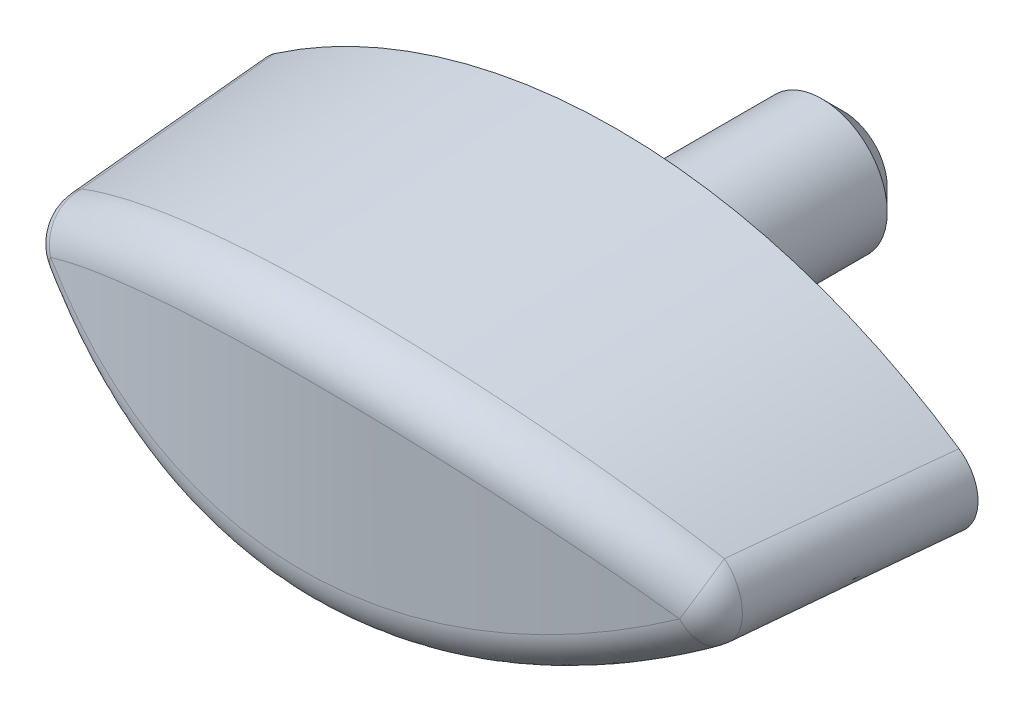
ISO-10303-21;
HEADER;
FILE_DESCRIPTION(('STEP AP214'),'2;1');
FILE_NAME('part.step','',(''),(''),'','','');
FILE_SCHEMA(('AUTOMOTIVE_DESIGN { 1 0 10303 214 1 1 1 1 }'));
ENDSEC;
DATA;
#1=APPLICATION_CONTEXT('core data for automotive mechanical design processes');
#2=APPLICATION_PROTOCOL_DEFINITION('international standard','automotive_design',2000,#1);
#3=PRODUCT_CONTEXT('',#1,'mechanical');
#4=PRODUCT('Part','Part','',(#3));
#5=PRODUCT_RELATED_PRODUCT_CATEGORY('part','',(#4));
#6=PRODUCT_DEFINITION_FORMATION('','',#4);
#7=PRODUCT_DEFINITION_CONTEXT('part definition',#1,'design');
#8=PRODUCT_DEFINITION('design','',#6,#7);
#9=PRODUCT_DEFINITION_SHAPE('','',#8);
#10=(LENGTH_UNIT() NAMED_UNIT(*) SI_UNIT(.MILLI.,.METRE.));
#11=(NAMED_UNIT(*) PLANE_ANGLE_UNIT() SI_UNIT($,.RADIAN.));
#12=(NAMED_UNIT(*) SI_UNIT($,.STERADIAN.) SOLID_ANGLE_UNIT());
#13=UNCERTAINTY_MEASURE_WITH_UNIT(LENGTH_MEASURE(1.E-05),#10,'distance_accuracy_value','');
#14=(GEOMETRIC_REPRESENTATION_CONTEXT(3) GLOBAL_UNCERTAINTY_ASSIGNED_CONTEXT((#13)) GLOBAL_UNIT_ASSIGNED_CONTEXT((#10,
#11,#12)) REPRESENTATION_CONTEXT('',''));
#15=CARTESIAN_POINT('',(0.,0.,0.));
#16=DIRECTION('',(0.,0.,1.));
#17=DIRECTION('',(1.,0.,0.));
#18=AXIS2_PLACEMENT_3D('',#15,#16,#17);
#19=CARTESIAN_POINT('',(-0.00046056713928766,-21.3,0.4));
#20=DIRECTION('',(0.,0.,-1.));
#21=DIRECTION('',(1.,0.,0.));
#22=AXIS2_PLACEMENT_3D('',#19,#20,#21);
#23=CONICAL_SURFACE('',#22,27.8,0.05235987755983);
#24=CARTESIAN_POINT('',(-0.00046056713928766,-21.3,0.4));
#25=DIRECTION('',(0.,0.,1.));
#26=DIRECTION('',(1.,0.,0.));
#27=AXIS2_PLACEMENT_3D('',#24,#25,#26);
#28=CIRCLE('',#27,27.8);
#29=CARTESIAN_POINT('',(15.6901745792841,1.6487247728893,0.4));
#30=VERTEX_POINT('',#29);
#31=CARTESIAN_POINT('',(-15.6910957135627,1.6487247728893,0.4));
#32=VERTEX_POINT('',#31);
#33=EDGE_CURVE('E235',#30,#32,#28,.T.);
#34=ORIENTED_EDGE('',*,*,#33,.T.);
#35=CARTESIAN_POINT('',(-14.153359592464,1.70103457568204,15.5404933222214));
#36=CARTESIAN_POINT('',(-15.0967597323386,1.11474020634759,15.6348374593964));
#37=CARTESIAN_POINT('',(-15.0967597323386,0.,15.6348374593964));
#38=CARTESIAN_POINT('',(-15.0967597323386,-1.11474020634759,15.6348374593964));
#39=CARTESIAN_POINT('',(-14.153359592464,-1.70103457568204,15.5404933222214));
#40=CARTESIAN_POINT('',(-14.3318556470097,1.69502029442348,13.8532547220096));
#41=CARTESIAN_POINT('',(-15.2654012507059,1.10725885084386,13.9484266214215));
#42=CARTESIAN_POINT('',(-15.2656662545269,0.,13.9457595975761));
#43=CARTESIAN_POINT('',(-15.2654012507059,-1.10725885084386,13.9484266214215));
#44=CARTESIAN_POINT('',(-14.3318556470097,-1.69502029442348,13.8532547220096));
#45=CARTESIAN_POINT('',(-14.5077422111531,1.68906895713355,12.1657858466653));
#46=CARTESIAN_POINT('',(-15.4319944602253,1.09998107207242,12.2590737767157));
#47=CARTESIAN_POINT('',(-15.4322394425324,0.,12.2565551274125));
#48=CARTESIAN_POINT('',(-15.4319944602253,-1.09998107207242,12.2590737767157));
#49=CARTESIAN_POINT('',(-14.5077422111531,-1.68906895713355,12.1657858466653));
#50=CARTESIAN_POINT('',(-14.8547932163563,1.67728860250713,8.79045641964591));
#51=CARTESIAN_POINT('',(-15.7609233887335,1.08581921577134,8.88044733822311));
#52=CARTESIAN_POINT('',(-15.7611684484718,0.,8.87793247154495));
#53=CARTESIAN_POINT('',(-15.7609233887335,-1.08581921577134,8.88044733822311));
#54=CARTESIAN_POINT('',(-14.8547932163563,-1.67728860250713,8.79045641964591));
#55=CARTESIAN_POINT('',(-15.0259577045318,1.6714595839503,7.10259587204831));
#56=CARTESIAN_POINT('',(-15.9233017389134,1.07893267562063,7.19086597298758));
#57=CARTESIAN_POINT('',(-15.9235243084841,0.,7.18851428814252));
#58=CARTESIAN_POINT('',(-15.9233017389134,-1.07893267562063,7.19086597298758));
#59=CARTESIAN_POINT('',(-15.0259577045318,-1.6714595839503,7.10259587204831));
#60=CARTESIAN_POINT('',(-15.6389500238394,1.6505385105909,0.981728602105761));
#61=CARTESIAN_POINT('',(-16.5038593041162,1.0546564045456,1.07851891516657));
#62=CARTESIAN_POINT('',(-16.5054048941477,0.,1.06226832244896));
#63=CARTESIAN_POINT('',(-16.5038593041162,-1.0546564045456,1.07851891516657));
#64=CARTESIAN_POINT('',(-15.6389500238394,-1.6505385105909,0.981728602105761));
#65=CARTESIAN_POINT('',(-16.0683322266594,1.63579618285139,-3.45232904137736));
#66=CARTESIAN_POINT('',(-16.9125731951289,1.03822558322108,-3.36118159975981));
#67=CARTESIAN_POINT('',(-16.9138312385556,0.,-3.37517244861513));
#68=CARTESIAN_POINT('',(-16.9125731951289,-1.03822558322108,-3.36118159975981));
#69=CARTESIAN_POINT('',(-16.0683322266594,-1.63579618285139,-3.45232904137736));
#70=CARTESIAN_POINT('',(-16.9043767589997,1.60706856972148,-12.3222655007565));
#71=CARTESIAN_POINT('',(-17.7092403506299,1.00727593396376,-12.2373342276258));
#72=CARTESIAN_POINT('',(-17.7104809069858,0.,-12.2511817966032));
#73=CARTESIAN_POINT('',(-17.7092403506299,-1.00727593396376,-12.2373342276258));
#74=CARTESIAN_POINT('',(-16.9043767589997,-1.60706856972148,-12.3222655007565));
#75=CARTESIAN_POINT('',(-17.3110389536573,1.59308328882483,-16.7581443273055));
#76=CARTESIAN_POINT('',(-18.0976673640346,0.99273181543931,-16.6776440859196));
#77=CARTESIAN_POINT('',(-18.0987041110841,0.,-16.6897503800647));
#78=CARTESIAN_POINT('',(-18.0976673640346,-0.99273181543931,-16.6776440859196));
#79=CARTESIAN_POINT('',(-17.3110389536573,-1.59308328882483,-16.7581443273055));
#80=CARTESIAN_POINT('',(-18.1060525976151,1.56581345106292,-25.63153463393));
#81=CARTESIAN_POINT('',(-18.8578714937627,0.965180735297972,-25.5559824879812));
#82=CARTESIAN_POINT('',(-18.8589022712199,0.,-25.5680225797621));
#83=CARTESIAN_POINT('',(-18.8578714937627,-0.965180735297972,-25.5559824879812));
#84=CARTESIAN_POINT('',(-18.1060525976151,-1.56581345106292,-25.63153463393));
#85=CARTESIAN_POINT('',(-18.4944030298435,1.55252893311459,-30.0690461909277));
#86=CARTESIAN_POINT('',(-19.2300008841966,0.952156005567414,-29.9970959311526));
#87=CARTESIAN_POINT('',(-19.2308763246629,0.,-30.0077262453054));
#88=CARTESIAN_POINT('',(-19.2300008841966,-0.952156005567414,-29.9970959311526));
#89=CARTESIAN_POINT('',(-18.4944030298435,-1.55252893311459,-30.0690461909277));
#90=CARTESIAN_POINT('',(-19.0655893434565,1.53309045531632,-36.7261060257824));
#91=CARTESIAN_POINT('',(-19.7785728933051,0.933545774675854,-36.6651612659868));
#92=CARTESIAN_POINT('',(-19.778789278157,0.,-36.6677969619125));
#93=CARTESIAN_POINT('',(-19.7785728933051,-0.933545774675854,-36.6651612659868));
#94=CARTESIAN_POINT('',(-19.0655893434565,-1.53309045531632,-36.7261060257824));
#95=CARTESIAN_POINT('',(-19.2540937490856,1.52669238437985,-38.9452441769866));
#96=CARTESIAN_POINT('',(-19.959549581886,0.927505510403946,-38.8853995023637));
#97=CARTESIAN_POINT('',(-19.9597511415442,0.,-38.8878925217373));
#98=CARTESIAN_POINT('',(-19.959549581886,-0.927505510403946,-38.8853995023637));
#99=CARTESIAN_POINT('',(-19.2540937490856,-1.52669238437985,-38.9452441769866));
#100=CARTESIAN_POINT('',(-19.6276330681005,1.51405317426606,-43.3837667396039));
#101=CARTESIAN_POINT('',(-20.3184015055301,0.915713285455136,-43.325766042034));
#102=CARTESIAN_POINT('',(-20.3186020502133,0.,-43.3282485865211));
#103=CARTESIAN_POINT('',(-20.3184015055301,-0.915713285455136,-43.325766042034));
#104=CARTESIAN_POINT('',(-19.6276330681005,-1.51405317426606,-43.3837667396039));
#105=CARTESIAN_POINT('',(-19.8126679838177,1.50781203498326,-45.6031511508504));
#106=CARTESIAN_POINT('',(-20.4963068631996,0.909959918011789,-45.5461814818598));
#107=CARTESIAN_POINT('',(-20.4964910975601,0.,-45.5485090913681));
#108=CARTESIAN_POINT('',(-20.4963068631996,-0.909959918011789,-45.5461814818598));
#109=CARTESIAN_POINT('',(-19.8126679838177,-1.50781203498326,-45.6031511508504));
#110=CARTESIAN_POINT('',(-19.9961229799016,1.50164645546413,-47.8226466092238));
#111=CARTESIAN_POINT('',(-20.6729817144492,0.904332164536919,-47.7688455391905));
#112=CARTESIAN_POINT('',(-20.6729817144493,0.,-47.7688455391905));
#113=CARTESIAN_POINT('',(-20.6729817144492,-0.904332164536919,-47.7688455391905));
#114=CARTESIAN_POINT('',(-19.9961229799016,-1.50164645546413,-47.8226466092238));
#115=(BOUNDED_SURFACE() B_SPLINE_SURFACE(3,2,((#35,#36,#37,#38,#39),(#40,#41,#42,#43,#44),(#45,
#46,#47,#48,#49),(#50,#51,#52,#53,#54),(#55,#56,#57,#58,#59),(#60,#61,#62,#63,#64),(#65,#66,#67,
#68,#69),(#70,#71,#72,#73,#74),(#75,#76,#77,#78,#79),(#80,#81,#82,#83,#84),(#85,#86,#87,#88,
#89),(#90,#91,#92,#93,#94),(#95,#96,#97,#98,#99),(#100,#101,#102,#103,#104),(#105,#106,#107,
#108,#109),(#110,#111,#112,#113,#114)),.UNSPECIFIED.,.F.,.F.,
.F.) B_SPLINE_SURFACE_WITH_KNOTS((4,2,2,2,2,2,2,4),(3,2,3),(0.,5.08695661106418,
10.1738624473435,23.5321935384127,36.8906039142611,50.2497553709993,56.9292475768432,
63.6087352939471),(0.,0.5,1.),
.UNSPECIFIED.) GEOMETRIC_REPRESENTATION_ITEM() RATIONAL_B_SPLINE_SURFACE(((1.,0.873483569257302,
1.,0.873483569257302,1.),(1.,0.874875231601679,1.,0.874875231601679,1.),(1.,0.876222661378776,
1.,0.876222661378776,1.),(1.,0.878837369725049,1.,0.878837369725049,1.),(1.,0.880104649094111,
1.,0.880104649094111,1.),(1.,0.884569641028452,1.,0.884569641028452,1.),(1.,0.887555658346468,
1.,0.887555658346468,1.),(1.,0.893140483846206,1.,0.893140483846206,1.),(1.,0.895739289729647,
1.,0.895739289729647,1.),(1.,0.90062485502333,1.,0.90062485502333,1.),(1.,0.902911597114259,1.,
0.902911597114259,1.),(1.,0.906149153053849,1.,0.906149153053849,1.),(1.,0.907196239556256,1.,
0.907196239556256,1.),(1.,0.909231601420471,1.,0.909231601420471,1.),(1.,0.9102198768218,1.,
0.9102198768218,1.),(1.,0.911181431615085,1.,0.911181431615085,1.))) REPRESENTATION_ITEM('') SURFACE());
#116=CARTESIAN_POINT('',(-19.9961229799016,1.50164645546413,-47.8226466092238));
#117=CARTESIAN_POINT('',(-19.8126679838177,1.50781203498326,-45.6031511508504));
#118=CARTESIAN_POINT('',(-19.6276330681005,1.51405317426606,-43.3837667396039));
#119=CARTESIAN_POINT('',(-19.2540937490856,1.52669238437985,-38.9452441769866));
#120=CARTESIAN_POINT('',(-19.0655893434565,1.53309045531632,-36.7261060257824));
#121=CARTESIAN_POINT('',(-18.4944030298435,1.55252893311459,-30.0690461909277));
#122=CARTESIAN_POINT('',(-18.1060525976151,1.56581345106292,-25.63153463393));
#123=CARTESIAN_POINT('',(-17.3110389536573,1.59308328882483,-16.7581443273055));
#124=CARTESIAN_POINT('',(-16.9043767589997,1.60706856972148,-12.3222655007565));
#125=CARTESIAN_POINT('',(-16.0683322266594,1.63579618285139,-3.45232904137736));
#126=CARTESIAN_POINT('',(-15.6389500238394,1.6505385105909,0.98172860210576));
#127=CARTESIAN_POINT('',(-15.0259577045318,1.6714595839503,7.10259587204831));
#128=CARTESIAN_POINT('',(-14.8547932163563,1.67728860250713,8.7904564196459));
#129=CARTESIAN_POINT('',(-14.5077422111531,1.68906895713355,12.1657858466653));
#130=CARTESIAN_POINT('',(-14.3318556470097,1.69502029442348,13.8532547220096));
#131=CARTESIAN_POINT('',(-14.153359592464,1.70103457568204,15.5404933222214));
#132=B_SPLINE_CURVE_WITH_KNOTS('',3,(#116,#117,#118,#119,#120,#121,#122,#123,#124,#125,#126,
#127,#128,#129,#130,#131),.UNSPECIFIED.,.F.,.F.,(4,2,2,2,2,2,2,4),(0.,6.67948771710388,
13.3589799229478,26.718131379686,40.0765417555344,53.4348728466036,58.5217786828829,
63.6087352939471),.UNSPECIFIED.);
#133=CARTESIAN_POINT('',(-14.7065623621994,1.6823200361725,10.2319467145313));
#134=VERTEX_POINT('',#133);
#135=EDGE_CURVE('E185',#32,#134,#132,.T.);
#136=ORIENTED_EDGE('',*,*,#135,.T.);
#137=CARTESIAN_POINT('',(-20.0811536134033,-4.41765469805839,9.05919102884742));
#138=CARTESIAN_POINT('',(-20.794375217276,-3.4970775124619,8.61347525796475));
#139=CARTESIAN_POINT('',(-20.5149823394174,-3.09184561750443,7.46781532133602));
#140=CARTESIAN_POINT('',(-19.815137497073,-4.14625680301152,9.22543510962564));
#141=CARTESIAN_POINT('',(-20.5308171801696,-3.20305312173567,8.78645329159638));
#142=CARTESIAN_POINT('',(-20.2437516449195,-2.79870414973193,7.62525685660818));
#143=CARTESIAN_POINT('',(-19.5427558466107,-3.88016952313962,9.39104448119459));
#144=CARTESIAN_POINT('',(-20.2613659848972,-2.91519162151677,8.95855393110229));
#145=CARTESIAN_POINT('',(-19.9659982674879,-2.51127069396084,7.78209729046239));
#146=CARTESIAN_POINT('',(-18.9853591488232,-3.35883373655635,9.72006316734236));
#147=CARTESIAN_POINT('',(-19.7089688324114,-2.34984852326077,9.30130522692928));
#148=CARTESIAN_POINT('',(-19.3975413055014,-1.94806022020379,8.09369459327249));
#149=CARTESIAN_POINT('',(-18.700343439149,-3.10358579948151,9.88347236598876));
#150=CARTESIAN_POINT('',(-19.4258932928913,-2.07241226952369,9.47196402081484));
#151=CARTESIAN_POINT('',(-19.1068370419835,-1.67228381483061,8.24845135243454));
#152=CARTESIAN_POINT('',(-17.8259485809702,-2.35396683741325,10.3693030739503));
#153=CARTESIAN_POINT('',(-18.5525101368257,-1.25251492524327,9.98255871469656));
#154=CARTESIAN_POINT('',(-18.214886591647,-0.862303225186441,8.70855755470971));
#155=CARTESIAN_POINT('',(-17.2177574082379,-1.8762677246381,10.6869893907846));
#156=CARTESIAN_POINT('',(-17.9443331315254,-0.729523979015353,10.3169263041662));
#157=CARTESIAN_POINT('',(-17.5943489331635,-0.346038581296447,9.00942253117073));
#158=CARTESIAN_POINT('',(-15.9491742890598,-0.965762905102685,11.3040494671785));
#159=CARTESIAN_POINT('',(-16.6701568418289,0.273374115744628,10.9703683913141));
#160=CARTESIAN_POINT('',(-16.2997263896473,0.638135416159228,9.59380956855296));
#161=CARTESIAN_POINT('',(-15.2884707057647,-0.533266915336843,11.6032917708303));
#162=CARTESIAN_POINT('',(-16.0031357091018,0.752117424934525,11.2889684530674));
#163=CARTESIAN_POINT('',(-15.6253216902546,1.1057110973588,9.87720713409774));
#164=CARTESIAN_POINT('',(-13.9208675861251,0.279150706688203,12.1737233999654));
#165=CARTESIAN_POINT('',(-14.6152521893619,1.65761638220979,11.9005576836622));
#166=CARTESIAN_POINT('',(-14.2290764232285,1.98415563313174,10.4174346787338));
#167=CARTESIAN_POINT('',(-13.2139942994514,0.659101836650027,12.4449284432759));
#168=CARTESIAN_POINT('',(-13.8940627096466,2.08328537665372,12.1929547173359));
#169=CARTESIAN_POINT('',(-13.5072628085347,2.3950563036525,10.6742795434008));
#170=CARTESIAN_POINT('',(-11.9037976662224,1.29127459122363,12.9012003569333));
#171=CARTESIAN_POINT('',(-12.5513754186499,2.79582931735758,12.6879484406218));
#172=CARTESIAN_POINT('',(-12.169137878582,3.07881265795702,11.106392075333));
#173=CARTESIAN_POINT('',(-11.3082180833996,1.55381959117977,13.092624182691));
#174=CARTESIAN_POINT('',(-11.937530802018,3.09343963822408,12.8968627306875));
#175=CARTESIAN_POINT('',(-11.5607814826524,3.36281474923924,11.2876801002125));
#176=CARTESIAN_POINT('',(-10.0920972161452,2.03992330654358,13.4495175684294));
#177=CARTESIAN_POINT('',(-10.6779261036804,3.64779713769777,13.2887861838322));
#178=CARTESIAN_POINT('',(-10.3184198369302,3.88869405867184,11.6256761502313));
#179=CARTESIAN_POINT('',(-9.47156072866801,2.26348947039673,13.6149920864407));
#180=CARTESIAN_POINT('',(-10.0325856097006,3.90376958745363,13.4712796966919));
#181=CARTESIAN_POINT('',(-9.68441951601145,4.13057932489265,11.7823888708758));
#182=CARTESIAN_POINT('',(-8.21085725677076,2.66837293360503,13.9161644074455));
#183=CARTESIAN_POINT('',(-8.71506821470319,4.37008842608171,13.8054592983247));
#184=CARTESIAN_POINT('',(-8.39623064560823,4.56867140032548,12.0676142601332));
#185=CARTESIAN_POINT('',(-7.57076855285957,2.84983870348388,14.0519667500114));
#186=CARTESIAN_POINT('',(-8.04373214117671,4.57980517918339,13.9567055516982));
#187=CARTESIAN_POINT('',(-7.74212254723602,4.76503873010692,12.1962259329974));
#188=CARTESIAN_POINT('',(-6.27276490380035,3.16913872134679,14.2916144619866));
#189=CARTESIAN_POINT('',(-6.67611405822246,4.95084987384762,14.2251405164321));
#190=CARTESIAN_POINT('',(-6.41558263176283,5.1105777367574,12.4231844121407));
#191=CARTESIAN_POINT('',(-5.6148541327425,3.30698309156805,14.3954672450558));
#192=CARTESIAN_POINT('',(-5.98095824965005,5.11144433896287,14.3418059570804));
#193=CARTESIAN_POINT('',(-5.74315510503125,5.25976036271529,12.5215382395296));
#194=CARTESIAN_POINT('',(-4.469550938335,3.50526400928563,14.5449044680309));
#195=CARTESIAN_POINT('',(-4.76699841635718,5.34334265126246,14.5103840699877));
#196=CARTESIAN_POINT('',(-4.57251302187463,5.47435769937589,12.663062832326));
#197=CARTESIAN_POINT('',(-3.98527879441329,3.57656511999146,14.5986601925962));
#198=CARTESIAN_POINT('',(-4.25248577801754,5.42691580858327,14.5711789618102));
#199=CARTESIAN_POINT('',(-4.07750634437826,5.55152868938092,12.7139722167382));
#200=CARTESIAN_POINT('',(-3.01174289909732,3.69472517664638,14.6875554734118));
#201=CARTESIAN_POINT('',(-3.21589634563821,5.56575349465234,14.6720040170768));
#202=CARTESIAN_POINT('',(-3.08236136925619,5.67941760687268,12.798160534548));
#203=CARTESIAN_POINT('',(-2.52247966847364,3.74158664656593,14.7226969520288));
#204=CARTESIAN_POINT('',(-2.69445046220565,5.62084543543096,14.7119082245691));
#205=CARTESIAN_POINT('',(-2.58222360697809,5.7301382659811,12.8314412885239));
#206=CARTESIAN_POINT('',(-1.54056281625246,3.81050009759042,14.7739283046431));
#207=CARTESIAN_POINT('',(-1.64628256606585,5.70198847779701,14.7702334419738));
#208=CARTESIAN_POINT('',(-1.57846523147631,5.80472574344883,12.8799599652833));
#209=CARTESIAN_POINT('',(-1.04790652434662,3.83252956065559,14.7900008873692));
#210=CARTESIAN_POINT('',(-1.12024397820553,5.72790625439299,14.7885569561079));
#211=CARTESIAN_POINT('',(-1.07484187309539,5.82856818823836,12.8951815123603));
#212=CARTESIAN_POINT('',(-0.0619125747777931,3.85152073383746,14.8028268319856));
#213=CARTESIAN_POINT('',(-0.0664657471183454,5.75020151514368,14.8032709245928));
#214=CARTESIAN_POINT('',(-0.0668941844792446,5.84911822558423,12.907328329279));
#215=CARTESIAN_POINT('',(0.431424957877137,3.84848655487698,14.799583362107));
#216=CARTESIAN_POINT('',(0.460560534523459,5.74655453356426,14.7996444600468));
#217=CARTESIAN_POINT('',(0.437430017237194,5.84583026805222,12.9042565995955));
#218=CARTESIAN_POINT('',(1.60255721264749,3.81150451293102,14.768936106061));
#219=CARTESIAN_POINT('',(1.71175123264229,5.70275305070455,14.7649470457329));
#220=CARTESIAN_POINT('',(1.63463358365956,5.80579033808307,12.8752321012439));
#221=CARTESIAN_POINT('',(2.27978109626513,3.76633440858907,14.7328856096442));
#222=CARTESIAN_POINT('',(2.43402260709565,5.64946733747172,14.7241316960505));
#223=CARTESIAN_POINT('',(2.32692566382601,5.75689079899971,12.8410904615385));
#224=CARTESIAN_POINT('',(3.62612133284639,3.62923557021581,14.6250252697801));
#225=CARTESIAN_POINT('',(3.86899032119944,5.48787530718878,14.6019758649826));
#226=CARTESIAN_POINT('',(3.70317371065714,5.60848345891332,12.7389412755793));
#227=CARTESIAN_POINT('',(4.295235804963,3.53729619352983,14.5532072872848));
#228=CARTESIAN_POINT('',(4.57997445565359,5.37995560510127,14.5209239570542));
#229=CARTESIAN_POINT('',(4.38712774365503,5.50896413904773,12.6709260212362));
#230=CARTESIAN_POINT('',(5.620453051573,3.30807293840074,14.3754561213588));
#231=CARTESIAN_POINT('',(5.98551056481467,5.11135398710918,14.3206149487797));
#232=CARTESIAN_POINT('',(5.74165729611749,5.26085961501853,12.5025866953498));
#233=CARTESIAN_POINT('',(6.27654930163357,3.17076690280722,14.2695062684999));
#234=CARTESIAN_POINT('',(6.67861072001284,4.95125521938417,14.2017864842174));
#235=CARTESIAN_POINT('',(6.41222610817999,5.11225043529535,12.4022468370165));
#236=CARTESIAN_POINT('',(7.57081563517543,2.85284943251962,14.0258788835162));
#237=CARTESIAN_POINT('',(8.04198725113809,4.58157504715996,13.9292868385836));
#238=CARTESIAN_POINT('',(7.73493729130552,4.76818970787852,12.1715194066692));
#239=CARTESIAN_POINT('',(8.20898646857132,2.67223981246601,13.8882026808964));
#240=CARTESIAN_POINT('',(8.71115884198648,4.37273579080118,13.7761497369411));
#241=CARTESIAN_POINT('',(8.38708043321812,4.57274012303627,12.0411330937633));
#242=CARTESIAN_POINT('',(9.45972662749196,2.27134461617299,13.5849607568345));
#243=CARTESIAN_POINT('',(10.018010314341,3.91078956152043,13.4400567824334));
#244=CARTESIAN_POINT('',(9.66507796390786,4.13894650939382,11.7539476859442));
#245=CARTESIAN_POINT('',(10.0724307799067,2.05131346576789,13.4195742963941));
#246=CARTESIAN_POINT('',(10.6550893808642,3.6587567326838,13.2578452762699));
#247=CARTESIAN_POINT('',(10.2910709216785,3.90087755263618,11.5973183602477));
#248=CARTESIAN_POINT('',(11.2734423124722,1.57331508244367,13.063501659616));
#249=CARTESIAN_POINT('',(11.8988735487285,3.11342074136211,12.8671751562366));
#250=CARTESIAN_POINT('',(11.5179880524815,3.38374983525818,11.2600996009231));
#251=CARTESIAN_POINT('',(11.861749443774,1.31534746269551,12.8728152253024));
#252=CARTESIAN_POINT('',(12.5051806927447,2.82087015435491,12.6592205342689));
#253=CARTESIAN_POINT('',(12.1189119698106,3.10469065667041,11.0795099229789));
#254=CARTESIAN_POINT('',(13.0124178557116,0.763585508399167,12.4692690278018));
#255=CARTESIAN_POINT('',(13.6860353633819,2.19779571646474,12.2210884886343));
#256=CARTESIAN_POINT('',(13.2941017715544,2.50788863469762,10.6973313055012));
#257=CARTESIAN_POINT('',(13.5747438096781,0.469744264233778,12.2563802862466));
#258=CARTESIAN_POINT('',(14.2604369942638,1.86790212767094,11.9913089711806));
#259=CARTESIAN_POINT('',(13.8683313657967,2.19009514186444,10.4957149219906));
#260=CARTESIAN_POINT('',(14.6709415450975,-0.151187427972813,11.8121448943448));
#261=CARTESIAN_POINT('',(15.3754021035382,1.17378101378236,11.5140037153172));
#262=CARTESIAN_POINT('',(14.9875696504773,1.51863734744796,10.0750015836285));
#263=CARTESIAN_POINT('',(15.2048097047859,-0.478282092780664,11.5807959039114));
#264=CARTESIAN_POINT('',(15.9160811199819,0.810131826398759,11.2668068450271));
#265=CARTESIAN_POINT('',(15.5325746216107,1.16496849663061,9.85590241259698));
#266=CARTESIAN_POINT('',(16.3010347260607,-1.2020925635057,11.076437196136));
#267=CARTESIAN_POINT('',(17.0209453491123,0.0093402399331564,10.7306608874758));
#268=CARTESIAN_POINT('',(16.6514893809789,0.38246399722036,9.37824925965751));
#269=CARTESIAN_POINT('',(16.859863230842,-1.60250195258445,10.8016660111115));
#270=CARTESIAN_POINT('',(17.5821760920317,-0.431467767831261,10.4400241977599));
#271=CARTESIAN_POINT('',(17.2217772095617,-0.0503529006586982,9.11802707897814));
#272=CARTESIAN_POINT('',(17.93940530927,-2.43944703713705,10.2387860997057));
#273=CARTESIAN_POINT('',(18.6616083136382,-1.34884391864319,9.84744151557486));
#274=CARTESIAN_POINT('',(18.3232481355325,-0.954885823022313,8.58495139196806));
#275=CARTESIAN_POINT('',(18.4601120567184,-2.87598917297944,9.95067499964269));
#276=CARTESIAN_POINT('',(19.1803900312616,-1.82496232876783,9.54563233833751));
#277=CARTESIAN_POINT('',(18.8544242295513,-1.42660878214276,8.31209563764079));
#278=CARTESIAN_POINT('',(19.4601451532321,-3.78132024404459,9.36761594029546));
#279=CARTESIAN_POINT('',(20.172691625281,-2.80841975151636,8.93752577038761));
#280=CARTESIAN_POINT('',(19.8743614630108,-2.40473038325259,7.75990928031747));
#281=CARTESIAN_POINT('',(19.9396415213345,-4.24996077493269,9.07270313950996));
#282=CARTESIAN_POINT('',(20.647062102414,-3.31530887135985,8.63125476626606));
#283=CARTESIAN_POINT('',(20.3632969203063,-2.91096939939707,7.4806119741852));
#284=CARTESIAN_POINT('',(20.6287720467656,-4.97711707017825,8.62854705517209));
#285=CARTESIAN_POINT('',(21.3283507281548,-4.10131871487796,8.17047222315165));
#286=CARTESIAN_POINT('',(21.0658500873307,-3.69632587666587,7.05997374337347));
#287=CARTESIAN_POINT('',(20.8534327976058,-5.22349757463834,8.48021886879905));
#288=CARTESIAN_POINT('',(21.5494719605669,-4.36633664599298,8.01734695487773));
#289=CARTESIAN_POINT('',(21.2948618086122,-3.96240386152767,6.91949946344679));
#290=CARTESIAN_POINT('',(21.2926427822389,-5.7242705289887,8.18366278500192));
#291=CARTESIAN_POINT('',(21.9810585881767,-4.90404357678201,7.71178627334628));
#292=CARTESIAN_POINT('',(21.7425310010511,-4.50316520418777,6.63864588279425));
#293=CARTESIAN_POINT('',(21.507191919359,-5.97866305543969,8.03543488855));
#294=CARTESIAN_POINT('',(22.1916197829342,-5.17672868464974,7.55932336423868));
#295=CARTESIAN_POINT('',(21.9611883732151,-4.77784864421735,6.49826658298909));
#296=CARTESIAN_POINT('',(21.7166323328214,-6.23702325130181,7.887613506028));
#297=CARTESIAN_POINT('',(22.3974453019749,-5.45401421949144,7.40710811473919));
#298=CARTESIAN_POINT('',(22.1746166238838,-5.05679182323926,6.35827227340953));
#299=(BOUNDED_SURFACE() B_SPLINE_SURFACE(3,2,((#137,#138,#139),(#140,#141,#142),(#143,#144,
#145),(#146,#147,#148),(#149,#150,#151),(#152,#153,#154),(#155,#156,#157),(#158,#159,#160),
(#161,#162,#163),(#164,#165,#166),(#167,#168,#169),(#170,#171,#172),(#173,#174,#175),(#176,#177,
#178),(#179,#180,#181),(#182,#183,#184),(#185,#186,#187),(#188,#189,#190),(#191,#192,#193),
(#194,#195,#196),(#197,#198,#199),(#200,#201,#202),(#203,#204,#205),(#206,#207,#208),(#209,#210,
#211),(#212,#213,#214),(#215,#216,#217),(#218,#219,#220),(#221,#222,#223),(#224,#225,#226),
(#227,#228,#229),(#230,#231,#232),(#233,#234,#235),(#236,#237,#238),(#239,#240,#241),(#242,#243,
#244),(#245,#246,#247),(#248,#249,#250),(#251,#252,#253),(#254,#255,#256),(#257,#258,#259),
(#260,#261,#262),(#263,#264,#265),(#266,#267,#268),(#269,#270,#271),(#272,#273,#274),(#275,#276,
#277),(#278,#279,#280),(#281,#282,#283),(#284,#285,#286),(#287,#288,#289),(#290,#291,#292),
(#293,#294,#295),(#296,#297,#298)),.UNSPECIFIED.,.F.,.F.,.F.) B_SPLINE_SURFACE_WITH_KNOTS((4,2,
2,2,2,2,2,2,2,2,2,2,2,2,2,2,2,2,2,2,2,2,2,2,2,2,4),(3,3),(0.,1.20698527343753,2.41403389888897,
4.8305598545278,7.26268570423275,9.6934406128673,11.6356284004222,13.5774446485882,
15.5123051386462,17.4467163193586,18.8465647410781,20.2462685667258,21.6472406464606,
23.0479829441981,24.9767574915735,26.9059711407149,28.8361284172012,30.7662048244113,
32.6842460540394,34.6023068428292,36.522903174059,38.4437433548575,40.580186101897,
42.7170104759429,44.844547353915,45.9080071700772,46.9714771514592),(0.,1.),
.UNSPECIFIED.) GEOMETRIC_REPRESENTATION_ITEM() RATIONAL_B_SPLINE_SURFACE(((1.,0.848585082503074,
1.),(1.,0.845596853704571,1.),(1.,0.842576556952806,1.),(1.,0.836489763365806,1.),(1.,
0.833423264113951,1.),(1.,0.82417564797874,1.),(1.,0.817952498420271,1.),(1.,0.805532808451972,
1.),(1.,0.79933669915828,1.),(1.,0.787223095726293,1.),(1.,0.781305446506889,1.),(1.,
0.771122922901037,1.),(1.,0.766764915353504,1.),(1.,0.758508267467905,1.),(1.,0.754609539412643,
1.),(1.,0.747416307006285,1.),(1.,0.744119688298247,1.),(1.,0.738238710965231,1.),(1.,
0.735654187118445,1.),(1.,0.731904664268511,1.),(1.,0.730544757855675,1.),(1.,0.728284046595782,
1.),(1.,0.727383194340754,1.),(1.,0.72606162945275,1.),(1.,0.72564135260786,1.),(1.,
0.725292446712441,1.),(1.,0.725363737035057,1.),(1.,0.726116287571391,1.),(1.,0.727017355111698,
1.),(1.,0.729709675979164,1.),(1.,0.731501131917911,1.),(1.,0.735896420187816,1.),(1.,
0.738500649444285,1.),(1.,0.74441421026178,1.),(1.,0.747723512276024,1.),(1.,0.754900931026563,
1.),(1.,0.75876543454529,1.),(1.,0.766940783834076,1.),(1.,0.771251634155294,1.),(1.,
0.780199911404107,1.),(1.,0.784837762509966,1.),(1.,0.794317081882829,1.),(1.,0.799158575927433,
1.),(1.,0.809486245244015,1.),(1.,0.814983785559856,1.),(1.,0.825966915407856,1.),(1.,
0.831452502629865,1.),(1.,0.842274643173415,1.),(1.,0.847611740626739,1.),(1.,0.855448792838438,
1.),(1.,0.858032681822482,1.),(1.,0.863134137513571,1.),(1.,0.865651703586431,1.),(1.,
0.868130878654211,1.))) REPRESENTATION_ITEM('') SURFACE());
#300=CARTESIAN_POINT('',(-20.5149823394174,-3.09184561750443,7.46781532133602));
#301=CARTESIAN_POINT('',(-20.2437516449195,-2.79870414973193,7.62525685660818));
#302=CARTESIAN_POINT('',(-19.9659982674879,-2.51127069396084,7.78209729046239));
#303=CARTESIAN_POINT('',(-19.3975413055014,-1.94806022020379,8.09369459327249));
#304=CARTESIAN_POINT('',(-19.1068370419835,-1.67228381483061,8.24845135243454));
#305=CARTESIAN_POINT('',(-18.214886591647,-0.862303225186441,8.70855755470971));
#306=CARTESIAN_POINT('',(-17.5943489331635,-0.346038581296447,9.00942253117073));
#307=CARTESIAN_POINT('',(-16.2997263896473,0.638135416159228,9.59380956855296));
#308=CARTESIAN_POINT('',(-15.6253216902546,1.1057110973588,9.87720713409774));
#309=CARTESIAN_POINT('',(-14.2290764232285,1.98415563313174,10.4174346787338));
#310=CARTESIAN_POINT('',(-13.5072628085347,2.3950563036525,10.6742795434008));
#311=CARTESIAN_POINT('',(-12.169137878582,3.07881265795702,11.106392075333));
#312=CARTESIAN_POINT('',(-11.5607814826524,3.36281474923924,11.2876801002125));
#313=CARTESIAN_POINT('',(-10.3184198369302,3.88869405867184,11.6256761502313));
#314=CARTESIAN_POINT('',(-9.68441951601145,4.13057932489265,11.7823888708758));
#315=CARTESIAN_POINT('',(-8.39623064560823,4.56867140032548,12.0676142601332));
#316=CARTESIAN_POINT('',(-7.74212254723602,4.76503873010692,12.1962259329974));
#317=CARTESIAN_POINT('',(-6.41558263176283,5.1105777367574,12.4231844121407));
#318=CARTESIAN_POINT('',(-5.74315510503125,5.25976036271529,12.5215382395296));
#319=CARTESIAN_POINT('',(-4.57251302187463,5.47435769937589,12.663062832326));
#320=CARTESIAN_POINT('',(-4.07750634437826,5.55152868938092,12.7139722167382));
#321=CARTESIAN_POINT('',(-3.08236136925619,5.67941760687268,12.798160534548));
#322=CARTESIAN_POINT('',(-2.58222360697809,5.7301382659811,12.8314412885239));
#323=CARTESIAN_POINT('',(-1.57846523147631,5.80472574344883,12.8799599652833));
#324=CARTESIAN_POINT('',(-1.07484187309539,5.82856818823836,12.8951815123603));
#325=CARTESIAN_POINT('',(-0.0668941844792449,5.84911822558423,12.907328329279));
#326=CARTESIAN_POINT('',(0.437430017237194,5.84583026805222,12.9042565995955));
#327=CARTESIAN_POINT('',(1.63463358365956,5.80579033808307,12.8752321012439));
#328=CARTESIAN_POINT('',(2.32692566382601,5.75689079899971,12.8410904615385));
#329=CARTESIAN_POINT('',(3.70317371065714,5.60848345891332,12.7389412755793));
#330=CARTESIAN_POINT('',(4.38712774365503,5.50896413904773,12.6709260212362));
#331=CARTESIAN_POINT('',(5.74165729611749,5.26085961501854,12.5025866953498));
#332=CARTESIAN_POINT('',(6.41222610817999,5.11225043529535,12.4022468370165));
#333=CARTESIAN_POINT('',(7.73493729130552,4.76818970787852,12.1715194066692));
#334=CARTESIAN_POINT('',(8.38708043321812,4.57274012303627,12.0411330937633));
#335=CARTESIAN_POINT('',(9.66507796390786,4.13894650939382,11.7539476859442));
#336=CARTESIAN_POINT('',(10.2910709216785,3.90087755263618,11.5973183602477));
#337=CARTESIAN_POINT('',(11.5179880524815,3.38374983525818,11.2600996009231));
#338=CARTESIAN_POINT('',(12.1189119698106,3.10469065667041,11.0795099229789));
#339=CARTESIAN_POINT('',(13.2941017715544,2.50788863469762,10.6973313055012));
#340=CARTESIAN_POINT('',(13.8683313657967,2.19009514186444,10.4957149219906));
#341=CARTESIAN_POINT('',(14.9875696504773,1.51863734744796,10.0750015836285));
#342=CARTESIAN_POINT('',(15.5325746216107,1.16496849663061,9.85590241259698));
#343=CARTESIAN_POINT('',(16.6514893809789,0.382463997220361,9.3782492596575));
#344=CARTESIAN_POINT('',(17.2217772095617,-0.0503529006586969,9.11802707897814));
#345=CARTESIAN_POINT('',(18.3232481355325,-0.954885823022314,8.58495139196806));
#346=CARTESIAN_POINT('',(18.8544242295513,-1.42660878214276,8.31209563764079));
#347=CARTESIAN_POINT('',(19.8743614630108,-2.40473038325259,7.75990928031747));
#348=CARTESIAN_POINT('',(20.3632969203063,-2.91096939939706,7.4806119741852));
#349=CARTESIAN_POINT('',(21.0658500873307,-3.69632587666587,7.05997374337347));
#350=CARTESIAN_POINT('',(21.2948618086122,-3.96240386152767,6.91949946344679));
#351=CARTESIAN_POINT('',(21.7425310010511,-4.50316520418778,6.63864588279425));
#352=CARTESIAN_POINT('',(21.9611883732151,-4.77784864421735,6.49826658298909));
#353=CARTESIAN_POINT('',(22.1746166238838,-5.05679182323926,6.35827227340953));
#354=B_SPLINE_CURVE_WITH_KNOTS('',3,(#300,#301,#302,#303,#304,#305,#306,#307,#308,#309,#310,
#311,#312,#313,#314,#315,#316,#317,#318,#319,#320,#321,#322,#323,#324,#325,#326,#327,#328,#329,
#330,#331,#332,#333,#334,#335,#336,#337,#338,#339,#340,#341,#342,#343,#344,#345,#346,#347,#348,
#349,#350,#351,#352,#353),.UNSPECIFIED.,.F.,.F.,(4,2,2,2,2,2,2,2,2,2,2,2,2,2,2,2,2,2,2,2,2,2,2,
2,2,2,4),(0.,1.20698527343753,2.41403389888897,4.8305598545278,7.26268570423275,9.6934406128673,
11.6356284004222,13.5774446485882,15.5123051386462,17.4467163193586,18.8465647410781,
20.2462685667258,21.6472406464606,23.0479829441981,24.9767574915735,26.9059711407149,
28.8361284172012,30.7662048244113,32.6842460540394,34.6023068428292,36.522903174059,
38.4437433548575,40.580186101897,42.7170104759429,44.844547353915,45.9080071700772,
46.9714771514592),.UNSPECIFIED.);
#355=CARTESIAN_POINT('',(14.7112145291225,1.68213078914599,10.1776618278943));
#356=VERTEX_POINT('',#355);
#357=EDGE_CURVE('E72',#134,#356,#354,.T.);
#358=ORIENTED_EDGE('',*,*,#357,.T.);
#359=CARTESIAN_POINT('',(14.1562950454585,-1.70090463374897,15.5040368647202));
#360=CARTESIAN_POINT('',(15.0994880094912,-1.11457832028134,15.5983412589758));
#361=CARTESIAN_POINT('',(15.0994880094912,0.,15.5983412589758));
#362=CARTESIAN_POINT('',(15.0994880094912,1.11457832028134,15.5983412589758));
#363=CARTESIAN_POINT('',(14.1562950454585,1.70090463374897,15.5040368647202));
#364=CARTESIAN_POINT('',(14.3346959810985,-1.69489318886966,13.8173363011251));
#365=CARTESIAN_POINT('',(15.2680418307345,-1.10710248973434,13.9124675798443));
#366=CARTESIAN_POINT('',(15.2683064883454,0.,13.9098035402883));
#367=CARTESIAN_POINT('',(15.2680418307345,1.10710248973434,13.9124675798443));
#368=CARTESIAN_POINT('',(14.3346959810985,1.69489318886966,13.8173363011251));
#369=CARTESIAN_POINT('',(14.5104911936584,-1.68894463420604,12.1304058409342));
#370=CARTESIAN_POINT('',(15.4345503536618,-1.09982994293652,12.22365530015));
#371=CARTESIAN_POINT('',(15.4347950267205,0.,12.2211393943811));
#372=CARTESIAN_POINT('',(15.4345503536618,1.09982994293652,12.22365530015));
#373=CARTESIAN_POINT('',(14.5104911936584,1.68894463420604,12.1304058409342));
#374=CARTESIAN_POINT('',(14.8573660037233,-1.67716974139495,8.75615384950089));
#375=CARTESIAN_POINT('',(15.7633158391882,-1.08567800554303,8.84610978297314));
#376=CARTESIAN_POINT('',(15.7635605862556,0.,8.84359767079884));
#377=CARTESIAN_POINT('',(15.7633158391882,1.08567800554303,8.84610978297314));
#378=CARTESIAN_POINT('',(14.8573660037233,1.67716974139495,8.75615384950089));
#379=CARTESIAN_POINT('',(15.0284456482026,-1.67134340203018,7.06883232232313));
#380=CARTESIAN_POINT('',(15.9256153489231,-1.07879615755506,7.15706930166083));
#381=CARTESIAN_POINT('',(15.9258376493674,0.,7.15472009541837));
#382=CARTESIAN_POINT('',(15.9256153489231,1.07879615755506,7.15706930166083));
#383=CARTESIAN_POINT('',(15.0284456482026,1.67134340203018,7.06883232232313));
#384=CARTESIAN_POINT('',(15.6412826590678,-1.65042700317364,0.948498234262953));
#385=CARTESIAN_POINT('',(16.5060318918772,-1.05453037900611,1.04525528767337));
#386=CARTESIAN_POINT('',(16.5075766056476,0.,1.02901136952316));
#387=CARTESIAN_POINT('',(16.5060318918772,1.05453037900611,1.04525528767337));
#388=CARTESIAN_POINT('',(15.6412826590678,1.65042700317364,0.948498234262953));
#389=CARTESIAN_POINT('',(16.0706012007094,-1.63568664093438,-3.48556450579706));
#390=CARTESIAN_POINT('',(16.914688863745,-1.03810484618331,-3.39444681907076));
#391=CARTESIAN_POINT('',(16.9159462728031,0.,-3.40843243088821));
#392=CARTESIAN_POINT('',(16.914688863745,1.03810484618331,-3.39444681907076));
#393=CARTESIAN_POINT('',(16.0706012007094,1.63568664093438,-3.48556450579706));
#394=CARTESIAN_POINT('',(16.9065313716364,-1.60696281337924,-12.3555098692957));
#395=CARTESIAN_POINT('',(17.7112542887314,-1.00716466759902,-12.2706047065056));
#396=CARTESIAN_POINT('',(17.7124942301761,0.,-12.2844471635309));
#397=CARTESIAN_POINT('',(17.7112542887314,1.00716466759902,-12.2706047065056));
#398=CARTESIAN_POINT('',(16.9065313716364,1.60696281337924,-12.3555098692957));
#399=CARTESIAN_POINT('',(17.3131428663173,-1.5929793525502,-16.7913925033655));
#400=CARTESIAN_POINT('',(18.0996361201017,-0.992624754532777,-16.7109159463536));
#401=CARTESIAN_POINT('',(18.1006724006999,0.,-16.7230181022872));
#402=CARTESIAN_POINT('',(18.0996361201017,0.992624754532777,-16.7109159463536));
#403=CARTESIAN_POINT('',(17.3131428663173,1.5929793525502,-16.7913925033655));
#404=CARTESIAN_POINT('',(18.1080644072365,-1.56571302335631,-25.6647892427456));
#405=CARTESIAN_POINT('',(18.859758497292,-0.965081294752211,-25.5892582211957));
#406=CARTESIAN_POINT('',(18.8607888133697,0.,-25.6012942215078));
#407=CARTESIAN_POINT('',(18.859758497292,0.965081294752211,-25.5892582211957));
#408=CARTESIAN_POINT('',(18.1080644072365,1.56571302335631,-25.6647892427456));
#409=CARTESIAN_POINT('',(18.4963734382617,-1.55243019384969,-30.1023034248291));
#410=CARTESIAN_POINT('',(19.2318510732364,-0.952059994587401,-30.0303725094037));
#411=CARTESIAN_POINT('',(19.2327261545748,0.,-30.0409994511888));
#412=CARTESIAN_POINT('',(19.2318510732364,0.952059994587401,-30.0303725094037));
#413=CARTESIAN_POINT('',(18.4963734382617,1.55243019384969,-30.1023034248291));
#414=CARTESIAN_POINT('',(19.0675028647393,-1.53299415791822,-36.7593667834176));
#415=CARTESIAN_POINT('',(19.7803723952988,-0.93345448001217,-36.6984374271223));
#416=CARTESIAN_POINT('',(19.7805886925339,0.,-36.7010722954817));
#417=CARTESIAN_POINT('',(19.7803723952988,0.93345448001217,-36.6984374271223));
#418=CARTESIAN_POINT('',(19.0675028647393,1.53299415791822,-36.7593667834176));
#419=CARTESIAN_POINT('',(19.2559891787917,-1.52659688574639,-38.9785060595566));
#420=CARTESIAN_POINT('',(19.9613330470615,-0.927415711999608,-38.9186762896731));
#421=CARTESIAN_POINT('',(19.961534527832,0.,-38.9211685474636));
#422=CARTESIAN_POINT('',(19.9613330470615,0.927415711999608,-38.9186762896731));
#423=CARTESIAN_POINT('',(19.2559891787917,1.52659688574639,-38.9785060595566));
#424=CARTESIAN_POINT('',(19.6294938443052,-1.51395924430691,-43.4170307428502));
#425=CARTESIAN_POINT('',(20.3201542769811,-0.915626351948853,-43.3590441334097));
#426=CARTESIAN_POINT('',(20.3203547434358,0.,-43.3615259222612));
#427=CARTESIAN_POINT('',(20.3201542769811,0.915626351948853,-43.3590441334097));
#428=CARTESIAN_POINT('',(19.6294938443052,1.51395924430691,-43.4170307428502));
#429=CARTESIAN_POINT('',(19.814512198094,-1.50771887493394,-45.6364161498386));
#430=CARTESIAN_POINT('',(20.4980449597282,-0.909874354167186,-45.5794601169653));
#431=CARTESIAN_POINT('',(20.498229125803,0.,-45.5817870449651));
#432=CARTESIAN_POINT('',(20.4980449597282,0.909874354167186,-45.5794601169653));
#433=CARTESIAN_POINT('',(19.814512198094,1.50771887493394,-45.6364161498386));
#434=CARTESIAN_POINT('',(19.9979512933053,-1.50155405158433,-47.8559125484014));
#435=CARTESIAN_POINT('',(20.6747056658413,-0.904247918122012,-47.8021240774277));
#436=CARTESIAN_POINT('',(20.6747056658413,0.,-47.8021240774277));
#437=CARTESIAN_POINT('',(20.6747056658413,0.904247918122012,-47.8021240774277));
#438=CARTESIAN_POINT('',(19.9979512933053,1.50155405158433,-47.8559125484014));
#439=(BOUNDED_SURFACE() B_SPLINE_SURFACE(3,2,((#359,#360,#361,#362,#363),(#364,#365,#366,#367,
#368),(#369,#370,#371,#372,#373),(#374,#375,#376,#377,#378),(#379,#380,#381,#382,#383),(#384,
#385,#386,#387,#388),(#389,#390,#391,#392,#393),(#394,#395,#396,#397,#398),(#399,#400,#401,#402,
#403),(#404,#405,#406,#407,#408),(#409,#410,#411,#412,#413),(#414,#415,#416,#417,#418),(#419,
#420,#421,#422,#423),(#424,#425,#426,#427,#428),(#429,#430,#431,#432,#433),(#434,#435,#436,#437,
#438)),.UNSPECIFIED.,.F.,.F.,.F.) B_SPLINE_SURFACE_WITH_KNOTS((4,2,2,2,2,2,2,4),(3,2,3),(0.,
5.08532431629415,10.1705979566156,23.528928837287,36.8873388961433,50.2464890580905,
56.9259807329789,63.605467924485),(0.,0.5,1.),
.UNSPECIFIED.) GEOMETRIC_REPRESENTATION_ITEM() RATIONAL_B_SPLINE_SURFACE(((1.,0.873513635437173,
1.,0.873513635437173,1.),(1.,0.874904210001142,1.,0.874904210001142,1.),(1.,0.876250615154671,
1.,0.876250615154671,1.),(1.,0.878863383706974,1.,0.878863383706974,1.),(1.,0.880129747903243,
1.,0.880129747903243,1.),(1.,0.884592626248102,1.,0.884592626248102,1.),(1.,0.887577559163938,
1.,0.887577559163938,1.),(1.,0.893160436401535,1.,0.893160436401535,1.),(1.,0.895758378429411,
1.,0.895758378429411,1.),(1.,0.90064237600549,1.,0.90064237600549,1.),(1.,0.902928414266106,1.,
0.902928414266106,1.),(1.,0.906165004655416,1.,0.906165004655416,1.),(1.,0.907211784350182,1.,
0.907211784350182,1.),(1.,0.90924655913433,1.,0.90924655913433,1.),(1.,0.910234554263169,1.,
0.910234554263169,1.),(1.,0.911195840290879,1.,0.911195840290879,1.))) REPRESENTATION_ITEM('') SURFACE());
#440=CARTESIAN_POINT('',(14.1562950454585,1.70090463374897,15.5040368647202));
#441=CARTESIAN_POINT('',(14.3346959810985,1.69489318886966,13.8173363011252));
#442=CARTESIAN_POINT('',(14.5104911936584,1.68894463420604,12.1304058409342));
#443=CARTESIAN_POINT('',(14.8573660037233,1.67716974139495,8.75615384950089));
#444=CARTESIAN_POINT('',(15.0284456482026,1.67134340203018,7.06883232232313));
#445=CARTESIAN_POINT('',(15.6412826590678,1.65042700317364,0.948498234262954));
#446=CARTESIAN_POINT('',(16.0706012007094,1.63568664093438,-3.48556450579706));
#447=CARTESIAN_POINT('',(16.9065313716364,1.60696281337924,-12.3555098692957));
#448=CARTESIAN_POINT('',(17.3131428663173,1.5929793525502,-16.7913925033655));
#449=CARTESIAN_POINT('',(18.1080644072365,1.56571302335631,-25.6647892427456));
#450=CARTESIAN_POINT('',(18.4963734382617,1.55243019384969,-30.1023034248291));
#451=CARTESIAN_POINT('',(19.0675028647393,1.53299415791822,-36.7593667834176));
#452=CARTESIAN_POINT('',(19.2559891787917,1.52659688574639,-38.9785060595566));
#453=CARTESIAN_POINT('',(19.6294938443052,1.51395924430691,-43.4170307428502));
#454=CARTESIAN_POINT('',(19.814512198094,1.50771887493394,-45.6364161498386));
#455=CARTESIAN_POINT('',(19.9979512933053,1.50155405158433,-47.8559125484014));
#456=B_SPLINE_CURVE_WITH_KNOTS('',3,(#440,#441,#442,#443,#444,#445,#446,#447,#448,#449,#450,
#451,#452,#453,#454,#455),.UNSPECIFIED.,.F.,.F.,(4,2,2,2,2,2,2,4),(0.,5.08532431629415,
10.1705979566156,23.528928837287,36.8873388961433,50.2464890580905,56.9259807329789,
63.605467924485),.UNSPECIFIED.);
#457=EDGE_CURVE('E95',#356,#30,#456,.T.);
#458=ORIENTED_EDGE('',*,*,#457,.T.);
#459=EDGE_LOOP('',(#34,#136,#358,#458));
#460=FACE_BOUND('',#459,.T.);
#461=ADVANCED_FACE('F14',(#460),#23,.T.);
#462=CARTESIAN_POINT('',(-0.00046056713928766,21.3,0.4));
#463=DIRECTION('',(0.,0.,-1.));
#464=DIRECTION('',(1.,0.,0.));
#465=AXIS2_PLACEMENT_3D('',#462,#463,#464);
#466=CONICAL_SURFACE('',#465,27.8,0.05235987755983);
#467=CARTESIAN_POINT('',(20.0711763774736,4.39496545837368,8.98554703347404));
#468=CARTESIAN_POINT('',(20.7792479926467,3.47446072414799,8.53942960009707));
#469=CARTESIAN_POINT('',(20.4973770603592,3.06756531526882,7.39807074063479));
#470=CARTESIAN_POINT('',(19.8044221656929,4.12351179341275,9.15361619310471));
#471=CARTESIAN_POINT('',(20.5150075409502,3.18036844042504,8.71420532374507));
#472=CARTESIAN_POINT('',(20.2254000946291,2.77436157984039,7.55724071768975));
#473=CARTESIAN_POINT('',(19.5312877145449,3.85738367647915,9.32103468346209));
#474=CARTESIAN_POINT('',(20.2448645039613,2.89245643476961,8.88808179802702));
#475=CARTESIAN_POINT('',(19.9468851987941,2.48688170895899,7.71579447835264));
#476=CARTESIAN_POINT('',(18.9723520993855,3.33599641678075,9.65363716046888));
#477=CARTESIAN_POINT('',(19.6910503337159,2.32703868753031,9.23435637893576));
#478=CARTESIAN_POINT('',(19.3768706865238,1.92361052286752,8.03078581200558));
#479=CARTESIAN_POINT('',(18.6865502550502,3.08073785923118,9.81882102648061));
#480=CARTESIAN_POINT('',(19.4072487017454,2.04957856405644,9.40676269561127));
#481=CARTESIAN_POINT('',(19.0853703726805,1.64781983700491,8.18722327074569));
#482=CARTESIAN_POINT('',(17.8097315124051,2.33112606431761,10.309928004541));
#483=CARTESIAN_POINT('',(18.5315995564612,1.22963003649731,9.92258907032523));
#484=CARTESIAN_POINT('',(18.1909641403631,0.837837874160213,8.65232636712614));
#485=CARTESIAN_POINT('',(17.1998469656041,1.85349242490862,10.6310591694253));
#486=CARTESIAN_POINT('',(17.9218405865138,0.706667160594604,10.2603668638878));
#487=CARTESIAN_POINT('',(17.5687091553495,0.321636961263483,8.95645378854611));
#488=CARTESIAN_POINT('',(15.9276647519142,0.943244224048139,11.2548675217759));
#489=CARTESIAN_POINT('',(16.6442758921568,-0.296070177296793,10.9205218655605));
#490=CARTESIAN_POINT('',(16.2704328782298,-0.662275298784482,9.5472317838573));
#491=CARTESIAN_POINT('',(15.2650518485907,0.510942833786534,11.5574110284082));
#492=CARTESIAN_POINT('',(15.9754380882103,-0.774672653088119,11.2424185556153));
#493=CARTESIAN_POINT('',(15.59408806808,-1.12964925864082,9.83375575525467));
#494=CARTESIAN_POINT('',(13.8934462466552,-0.300890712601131,12.1342282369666));
#495=CARTESIAN_POINT('',(14.5837091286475,-1.67970988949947,11.860420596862));
#496=CARTESIAN_POINT('',(14.1937723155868,-2.00748082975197,10.3800307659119));
#497=CARTESIAN_POINT('',(13.1844802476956,-0.680452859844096,12.4085179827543));
#498=CARTESIAN_POINT('',(13.8604861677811,-2.10505205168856,12.1559271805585));
#499=CARTESIAN_POINT('',(13.4698287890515,-2.41797078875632,10.6397969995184));
#500=CARTESIAN_POINT('',(11.8717740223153,-1.31102657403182,12.8696160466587));
#501=CARTESIAN_POINT('',(12.5154209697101,-2.81601362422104,12.6557631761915));
#502=CARTESIAN_POINT('',(12.1291518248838,-3.10001637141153,11.0764801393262));
#503=CARTESIAN_POINT('',(11.2758775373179,-1.57249409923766,13.0628813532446));
#504=CARTESIAN_POINT('',(11.9013231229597,-3.1125135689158,12.8665158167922));
#505=CARTESIAN_POINT('',(11.5204762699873,-3.3828614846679,11.2595121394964));
#506=CARTESIAN_POINT('',(10.0591290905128,-2.05645798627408,13.4234153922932));
#507=CARTESIAN_POINT('',(10.6412133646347,-3.66467051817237,13.2620914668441));
#508=CARTESIAN_POINT('',(10.277481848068,-3.9064433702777,11.6009560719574));
#509=CARTESIAN_POINT('',(9.43828195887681,-2.27896184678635,13.5906891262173));
#510=CARTESIAN_POINT('',(9.9956198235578,-3.91955361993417,13.446395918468));
#511=CARTESIAN_POINT('',(9.64316794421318,-4.14718824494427,11.7593727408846));
#512=CARTESIAN_POINT('',(8.17697143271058,-2.6817246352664,13.8954120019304));
#513=CARTESIAN_POINT('',(8.67760217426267,-4.38370136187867,13.7841670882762));
#514=CARTESIAN_POINT('',(8.35436561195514,-4.5830039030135,12.0479606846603));
#515=CARTESIAN_POINT('',(7.53658682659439,-2.8621329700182,14.0329664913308));
#516=CARTESIAN_POINT('',(8.00601824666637,-4.59233816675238,13.9371911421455));
#517=CARTESIAN_POINT('',(7.69995815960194,-4.77823621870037,12.178231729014));
#518=CARTESIAN_POINT('',(6.23798656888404,-3.17931342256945,14.2760838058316));
#519=CARTESIAN_POINT('',(6.63788624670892,-4.96122103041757,14.2091639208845));
#520=CARTESIAN_POINT('',(6.37281380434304,-5.12150022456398,12.4084760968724));
#521=CARTESIAN_POINT('',(5.57977513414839,-3.31609576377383,14.3816541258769));
#522=CARTESIAN_POINT('',(5.94246370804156,-5.12073444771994,14.3275849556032));
#523=CARTESIAN_POINT('',(5.70008123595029,-5.26954297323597,12.5084565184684));
#524=CARTESIAN_POINT('',(4.4356763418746,-3.51223605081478,14.5337924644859));
#525=CARTESIAN_POINT('',(4.72986968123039,-5.35040739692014,14.4989082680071));
#526=CARTESIAN_POINT('',(4.53067341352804,-5.48184001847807,12.6525392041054));
#527=CARTESIAN_POINT('',(3.95293516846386,-3.58254806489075,14.5886044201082));
#528=CARTESIAN_POINT('',(4.21701264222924,-5.43294117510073,14.5607718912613));
#529=CARTESIAN_POINT('',(4.03723285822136,-5.55794742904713,12.7044488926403));
#530=CARTESIAN_POINT('',(2.98248649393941,-3.69889418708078,14.6797301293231));
#531=CARTESIAN_POINT('',(3.18376751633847,-5.56989156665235,14.6638731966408));
#532=CARTESIAN_POINT('',(3.04524572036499,-5.68388699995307,12.790749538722));
#533=CARTESIAN_POINT('',(2.49477951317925,-3.74493081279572,14.7160458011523));
#534=CARTESIAN_POINT('',(2.66400363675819,-5.62413755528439,14.7049840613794));
#535=CARTESIAN_POINT('',(2.54669967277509,-5.73372188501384,12.8251423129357));
#536=CARTESIAN_POINT('',(1.5159784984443,-3.81235705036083,14.769748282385));
#537=CARTESIAN_POINT('',(1.61920237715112,-5.70378043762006,14.7658668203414));
#538=CARTESIAN_POINT('',(1.54612776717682,-5.80671371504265,12.8760012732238));
#539=CARTESIAN_POINT('',(1.02488178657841,-3.83372419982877,14.7871178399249));
#540=CARTESIAN_POINT('',(1.0948413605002,-5.72904508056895,14.785539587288));
#541=CARTESIAN_POINT('',(1.04409915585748,-5.82984634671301,12.8924511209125));
#542=CARTESIAN_POINT('',(0.0419881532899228,-3.85154993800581,14.80265916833));
#543=CARTESIAN_POINT('',(0.0443894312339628,-5.75022234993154,14.8030936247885));
#544=CARTESIAN_POINT('',(0.0393212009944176,-5.84914908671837,12.9071695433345));
#545=CARTESIAN_POINT('',(-0.44980864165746,-3.84801256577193,14.8008340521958));
#546=CARTESIAN_POINT('',(-0.480995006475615,-5.74611039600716,14.800955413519));
#547=CARTESIAN_POINT('',(-0.463428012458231,-5.84532356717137,12.9054410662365));
#548=CARTESIAN_POINT('',(-1.61889966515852,-3.80996365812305,14.7736627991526));
#549=CARTESIAN_POINT('',(-1.73004248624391,-5.70135529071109,14.7699142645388));
#550=CARTESIAN_POINT('',(-1.65854575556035,-5.80414572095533,12.8797085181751));
#551=CARTESIAN_POINT('',(-2.29563456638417,-3.76418779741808,14.7396383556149));
#552=CARTESIAN_POINT('',(-2.45182904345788,-5.64752943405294,14.7312253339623));
#553=CARTESIAN_POINT('',(-2.35033900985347,-5.75460026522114,12.8474856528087));
#554=CARTESIAN_POINT('',(-3.64106479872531,-3.62592539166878,14.6358753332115));
#555=CARTESIAN_POINT('',(-3.8859359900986,-5.4849064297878,14.6133677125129));
#556=CARTESIAN_POINT('',(-3.72566002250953,-5.60495285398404,12.7492168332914));
#557=CARTESIAN_POINT('',(-4.30975825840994,-3.53342818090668,14.5661285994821));
#558=CARTESIAN_POINT('',(-4.59654485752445,-5.37649382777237,14.5344798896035));
#559=CARTESIAN_POINT('',(-4.40918585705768,-5.50483935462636,12.6831631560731));
#560=CARTESIAN_POINT('',(-5.63420225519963,-3.30311687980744,14.3925557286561));
#561=CARTESIAN_POINT('',(-6.00143708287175,-5.10692629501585,14.3385250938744));
#562=CARTESIAN_POINT('',(-5.76293046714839,-5.25557613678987,12.5187808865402));
#563=CARTESIAN_POINT('',(-6.28994629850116,-3.16528063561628,14.2887129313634));
#564=CARTESIAN_POINT('',(-6.69426688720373,-4.94635276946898,14.22187988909));
#565=CARTESIAN_POINT('',(-6.43314256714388,-5.10640244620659,12.420436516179));
#566=CARTESIAN_POINT('',(-7.58357185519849,-2.8463119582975,14.0493257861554));
#567=CARTESIAN_POINT('',(-8.05719674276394,-4.57571756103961,13.9537555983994));
#568=CARTESIAN_POINT('',(-7.75520649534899,-4.76122233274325,12.1937248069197));
#569=CARTESIAN_POINT('',(-8.22145412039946,-2.6651813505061,13.91378277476));
#570=CARTESIAN_POINT('',(-8.72618848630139,-4.3663970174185,13.8028050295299));
#571=CARTESIAN_POINT('',(-8.4070590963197,-4.56521788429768,12.0653587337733));
#572=CARTESIAN_POINT('',(-9.47169615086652,-2.26323275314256,13.6148087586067));
#573=CARTESIAN_POINT('',(-10.0327800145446,-3.90345687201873,13.4710644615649));
#574=CARTESIAN_POINT('',(-9.6845573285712,-4.13030171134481,11.7822152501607));
#575=CARTESIAN_POINT('',(-10.0841896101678,-2.04266772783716,13.4515558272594));
#576=CARTESIAN_POINT('',(-10.6697735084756,-3.65090969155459,13.2910134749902));
#577=CARTESIAN_POINT('',(-10.3103403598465,-3.89166348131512,11.6276064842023));
#578=CARTESIAN_POINT('',(-11.2848187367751,-1.5635785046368,13.0997663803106));
#579=CARTESIAN_POINT('',(-11.913436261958,-3.10450212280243,12.9046579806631));
#580=CARTESIAN_POINT('',(-11.5368784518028,-3.37337176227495,11.2944441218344));
#581=CARTESIAN_POINT('',(-11.8729541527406,-1.30505391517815,12.9112296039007));
#582=CARTESIAN_POINT('',(-12.5197030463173,-2.81139498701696,12.6988548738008));
#583=CARTESIAN_POINT('',(-12.1376332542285,-3.09371785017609,11.1158902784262));
#584=CARTESIAN_POINT('',(-13.0233014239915,-0.752145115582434,12.5120037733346));
#585=CARTESIAN_POINT('',(-13.7005022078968,-2.18715607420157,12.2650256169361));
#586=CARTESIAN_POINT('',(-13.3125085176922,-2.49569024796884,10.7378032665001));
#587=CARTESIAN_POINT('',(-13.5854780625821,-0.457714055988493,12.3012858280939));
#588=CARTESIAN_POINT('',(-14.2748846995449,-1.85665580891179,12.0373959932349));
#589=CARTESIAN_POINT('',(-13.8865928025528,-2.17726597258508,10.5382427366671));
#590=CARTESIAN_POINT('',(-14.6813856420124,0.164437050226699,11.8614146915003));
#591=CARTESIAN_POINT('',(-15.3898168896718,-1.16126550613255,11.5643944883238));
#592=CARTESIAN_POINT('',(-15.0055499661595,-1.50450301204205,10.121662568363));
#593=CARTESIAN_POINT('',(-15.2151129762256,0.492161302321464,11.6322591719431));
#594=CARTESIAN_POINT('',(-15.9304788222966,-0.796955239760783,11.3193508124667));
#595=CARTESIAN_POINT('',(-15.5504191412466,-1.15015978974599,9.90464072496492));
#596=CARTESIAN_POINT('',(-16.3105594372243,1.21703506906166,11.1327808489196));
#597=CARTESIAN_POINT('',(-17.0348222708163,0.00495104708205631,10.7879910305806));
#598=CARTESIAN_POINT('',(-16.6685568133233,-0.366518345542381,9.43160954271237));
#599=CARTESIAN_POINT('',(-16.8687794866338,1.61785175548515,10.8607151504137));
#600=CARTESIAN_POINT('',(-17.5955706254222,0.446182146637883,10.5000089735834));
#601=CARTESIAN_POINT('',(-17.2382335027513,0.0667327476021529,9.17394959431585));
#602=CARTESIAN_POINT('',(-17.9471354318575,2.455609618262,10.3033139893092));
#603=CARTESIAN_POINT('',(-18.674065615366,1.3644151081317,9.91278555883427));
#604=CARTESIAN_POINT('',(-18.3385147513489,0.972133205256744,8.64606256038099));
#605=CARTESIAN_POINT('',(-18.4672645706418,2.89255717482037,10.0179761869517));
#606=CARTESIAN_POINT('',(-19.1923889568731,1.84096667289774,9.61368110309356));
#607=CARTESIAN_POINT('',(-18.8691123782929,1.44428943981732,8.3758332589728));
#608=CARTESIAN_POINT('',(-19.4661685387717,3.79870846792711,9.4405129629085));
#609=CARTESIAN_POINT('',(-20.1837929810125,2.82531010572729,9.01101929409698));
#610=CARTESIAN_POINT('',(-19.8879203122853,2.42328899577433,7.82894644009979));
#611=CARTESIAN_POINT('',(-19.9451123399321,4.26776467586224,9.14842219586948));
#612=CARTESIAN_POINT('',(-20.6577207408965,3.33265275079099,8.70748838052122));
#613=CARTESIAN_POINT('',(-20.376303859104,2.92997362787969,7.55232174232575));
#614=CARTESIAN_POINT('',(-20.6334053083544,4.99554004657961,8.70854874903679));
#615=CARTESIAN_POINT('',(-21.3383245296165,4.11934032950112,8.25087323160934));
#616=CARTESIAN_POINT('',(-21.0780209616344,3.71599478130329,7.13573938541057));
#617=CARTESIAN_POINT('',(-20.8577860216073,5.24212682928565,8.56165576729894));
#618=CARTESIAN_POINT('',(-21.5592174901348,4.38458596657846,8.09913841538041));
#619=CARTESIAN_POINT('',(-21.3067532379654,3.98229441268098,6.99662431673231));
#620=CARTESIAN_POINT('',(-21.2964299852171,5.74330865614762,8.26798666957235));
#621=CARTESIAN_POINT('',(-21.9903394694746,4.92274579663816,7.79637310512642));
#622=CARTESIAN_POINT('',(-21.7538576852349,4.52349544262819,6.71850485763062));
#623=CARTESIAN_POINT('',(-21.5106931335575,5.99790378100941,8.12121055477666));
#624=CARTESIAN_POINT('',(-22.2006641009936,5.19565616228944,7.64531529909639));
#625=CARTESIAN_POINT('',(-21.9722297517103,4.79839692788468,6.57950046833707));
#626=CARTESIAN_POINT('',(-21.7198432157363,6.2564636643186,7.97484913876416));
#627=CARTESIAN_POINT('',(-22.4062458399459,5.47316356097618,7.49451745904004));
#628=CARTESIAN_POINT('',(-22.185368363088,5.07755520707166,6.4408888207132));
#629=(BOUNDED_SURFACE() B_SPLINE_SURFACE(3,2,((#467,#468,#469),(#470,#471,#472),(#473,#474,
#475),(#476,#477,#478),(#479,#480,#481),(#482,#483,#484),(#485,#486,#487),(#488,#489,#490),
(#491,#492,#493),(#494,#495,#496),(#497,#498,#499),(#500,#501,#502),(#503,#504,#505),(#506,#507,
#508),(#509,#510,#511),(#512,#513,#514),(#515,#516,#517),(#518,#519,#520),(#521,#522,#523),
(#524,#525,#526),(#527,#528,#529),(#530,#531,#532),(#533,#534,#535),(#536,#537,#538),(#539,#540,
#541),(#542,#543,#544),(#545,#546,#547),(#548,#549,#550),(#551,#552,#553),(#554,#555,#556),
(#557,#558,#559),(#560,#561,#562),(#563,#564,#565),(#566,#567,#568),(#569,#570,#571),(#572,#573,
#574),(#575,#576,#577),(#578,#579,#580),(#581,#582,#583),(#584,#585,#586),(#587,#588,#589),
(#590,#591,#592),(#593,#594,#595),(#596,#597,#598),(#599,#600,#601),(#602,#603,#604),(#605,#606,
#607),(#608,#609,#610),(#611,#612,#613),(#614,#615,#616),(#617,#618,#619),(#620,#621,#622),
(#623,#624,#625),(#626,#627,#628)),.UNSPECIFIED.,.F.,.F.,.F.) B_SPLINE_SURFACE_WITH_KNOTS((4,2,
2,2,2,2,2,2,2,2,2,2,2,2,2,2,2,2,2,2,2,2,2,2,2,2,4),(3,3),(0.,1.21044756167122,2.42096021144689,
4.84445920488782,7.28372831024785,9.7216045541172,11.6647415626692,13.6075041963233,
15.5432629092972,17.4785676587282,18.8740339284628,20.2693554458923,21.6659464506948,
23.0623109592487,24.9895378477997,26.9172048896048,28.8458152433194,30.7743442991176,
32.690919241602,34.6075139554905,36.5266366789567,38.4460021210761,40.5790545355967,
42.7124844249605,44.83669627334,45.8984997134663,46.9603138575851),(0.,1.),
.UNSPECIFIED.) GEOMETRIC_REPRESENTATION_ITEM() RATIONAL_B_SPLINE_SURFACE(((1.,0.849127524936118,
1.),(1.,0.846126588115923,1.),(1.,0.843093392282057,1.),(1.,0.836980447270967,1.),(1.,
0.833900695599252,1.),(1.,0.824612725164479,1.),(1.,0.818361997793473,1.),(1.,0.80588601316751,
1.),(1.,0.799661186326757,1.),(1.,0.787490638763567,1.),(1.,0.781544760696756,1.),(1.,
0.771324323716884,1.),(1.,0.766955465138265,1.),(1.,0.758676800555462,1.),(1.,0.754766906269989,
1.),(1.,0.747551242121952,1.),(1.,0.744243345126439,1.),(1.,0.738339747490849,1.),(1.,
0.735743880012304,1.),(1.,0.731980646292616,1.),(1.,0.73061679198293,1.),(1.,0.728344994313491,
1.),(1.,0.727437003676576,1.),(1.,0.726097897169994,1.),(1.,0.725667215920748,1.),(1.,
0.725294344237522,1.),(1.,0.725352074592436,1.),(1.,0.726069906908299,1.),(1.,0.726950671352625,
1.),(1.,0.729601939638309,1.),(1.,0.731372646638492,1.),(1.,0.735726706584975,1.),(1.,
0.738310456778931,1.),(1.,0.744183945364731,1.),(1.,0.747473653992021,1.),(1.,0.754613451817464,
1.),(1.,0.758459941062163,1.),(1.,0.766600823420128,1.),(1.,0.770895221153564,1.),(1.,
0.779812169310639,1.),(1.,0.784435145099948,1.),(1.,0.793886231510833,1.),(1.,0.798714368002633,
1.),(1.,0.809010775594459,1.),(1.,0.814490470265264,1.),(1.,0.825439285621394,1.),(1.,
0.830908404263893,1.),(1.,0.841699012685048,1.),(1.,0.847021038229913,1.),(1.,0.854836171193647,
1.),(1.,0.857412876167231,1.),(1.,0.862500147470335,1.),(1.,0.865010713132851,1.),(1.,
0.867482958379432,1.))) REPRESENTATION_ITEM('') SURFACE());
#630=CARTESIAN_POINT('',(20.4973770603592,3.06756531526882,7.39807074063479));
#631=CARTESIAN_POINT('',(20.2254000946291,2.77436157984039,7.55724071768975));
#632=CARTESIAN_POINT('',(19.9468851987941,2.48688170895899,7.71579447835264));
#633=CARTESIAN_POINT('',(19.3768706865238,1.92361052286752,8.03078581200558));
#634=CARTESIAN_POINT('',(19.0853703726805,1.64781983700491,8.18722327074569));
#635=CARTESIAN_POINT('',(18.1909641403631,0.837837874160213,8.65232636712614));
#636=CARTESIAN_POINT('',(17.5687091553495,0.321636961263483,8.95645378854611));
#637=CARTESIAN_POINT('',(16.2704328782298,-0.662275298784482,9.5472317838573));
#638=CARTESIAN_POINT('',(15.59408806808,-1.12964925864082,9.83375575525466));
#639=CARTESIAN_POINT('',(14.1937723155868,-2.00748082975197,10.3800307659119));
#640=CARTESIAN_POINT('',(13.4698287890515,-2.41797078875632,10.6397969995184));
#641=CARTESIAN_POINT('',(12.1291518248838,-3.10001637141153,11.0764801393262));
#642=CARTESIAN_POINT('',(11.5204762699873,-3.3828614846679,11.2595121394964));
#643=CARTESIAN_POINT('',(10.277481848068,-3.9064433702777,11.6009560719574));
#644=CARTESIAN_POINT('',(9.64316794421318,-4.14718824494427,11.7593727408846));
#645=CARTESIAN_POINT('',(8.35436561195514,-4.5830039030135,12.0479606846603));
#646=CARTESIAN_POINT('',(7.69995815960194,-4.77823621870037,12.178231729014));
#647=CARTESIAN_POINT('',(6.37281380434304,-5.12150022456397,12.4084760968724));
#648=CARTESIAN_POINT('',(5.70008123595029,-5.26954297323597,12.5084565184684));
#649=CARTESIAN_POINT('',(4.53067341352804,-5.48184001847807,12.6525392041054));
#650=CARTESIAN_POINT('',(4.03723285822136,-5.55794742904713,12.7044488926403));
#651=CARTESIAN_POINT('',(3.04524572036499,-5.68388699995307,12.790749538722));
#652=CARTESIAN_POINT('',(2.54669967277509,-5.73372188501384,12.8251423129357));
#653=CARTESIAN_POINT('',(1.54612776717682,-5.80671371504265,12.8760012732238));
#654=CARTESIAN_POINT('',(1.04409915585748,-5.82984634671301,12.8924511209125));
#655=CARTESIAN_POINT('',(0.0393212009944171,-5.84914908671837,12.9071695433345));
#656=CARTESIAN_POINT('',(-0.463428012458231,-5.84532356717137,12.9054410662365));
#657=CARTESIAN_POINT('',(-1.65854575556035,-5.80414572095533,12.8797085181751));
#658=CARTESIAN_POINT('',(-2.35033900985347,-5.75460026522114,12.8474856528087));
#659=CARTESIAN_POINT('',(-3.72566002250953,-5.60495285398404,12.7492168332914));
#660=CARTESIAN_POINT('',(-4.40918585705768,-5.50483935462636,12.6831631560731));
#661=CARTESIAN_POINT('',(-5.76293046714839,-5.25557613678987,12.5187808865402));
#662=CARTESIAN_POINT('',(-6.43314256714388,-5.10640244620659,12.420436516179));
#663=CARTESIAN_POINT('',(-7.75520649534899,-4.76122233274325,12.1937248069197));
#664=CARTESIAN_POINT('',(-8.4070590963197,-4.56521788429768,12.0653587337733));
#665=CARTESIAN_POINT('',(-9.6845573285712,-4.13030171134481,11.7822152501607));
#666=CARTESIAN_POINT('',(-10.3103403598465,-3.89166348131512,11.6276064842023));
#667=CARTESIAN_POINT('',(-11.5368784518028,-3.37337176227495,11.2944441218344));
#668=CARTESIAN_POINT('',(-12.1376332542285,-3.09371785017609,11.1158902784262));
#669=CARTESIAN_POINT('',(-13.3125085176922,-2.49569024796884,10.7378032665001));
#670=CARTESIAN_POINT('',(-13.8865928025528,-2.17726597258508,10.5382427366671));
#671=CARTESIAN_POINT('',(-15.0055499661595,-1.50450301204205,10.121662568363));
#672=CARTESIAN_POINT('',(-15.5504191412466,-1.15015978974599,9.90464072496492));
#673=CARTESIAN_POINT('',(-16.6685568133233,-0.366518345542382,9.43160954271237));
#674=CARTESIAN_POINT('',(-17.2382335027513,0.066732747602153,9.17394959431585));
#675=CARTESIAN_POINT('',(-18.3385147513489,0.972133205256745,8.64606256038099));
#676=CARTESIAN_POINT('',(-18.8691123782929,1.44428943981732,8.3758332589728));
#677=CARTESIAN_POINT('',(-19.8879203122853,2.42328899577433,7.82894644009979));
#678=CARTESIAN_POINT('',(-20.376303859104,2.92997362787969,7.55232174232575));
#679=CARTESIAN_POINT('',(-21.0780209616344,3.71599478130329,7.13573938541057));
#680=CARTESIAN_POINT('',(-21.3067532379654,3.98229441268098,6.99662431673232));
#681=CARTESIAN_POINT('',(-21.7538576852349,4.52349544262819,6.71850485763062));
#682=CARTESIAN_POINT('',(-21.9722297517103,4.79839692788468,6.57950046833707));
#683=CARTESIAN_POINT('',(-22.185368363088,5.07755520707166,6.4408888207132));
#684=B_SPLINE_CURVE_WITH_KNOTS('',3,(#630,#631,#632,#633,#634,#635,#636,#637,#638,#639,#640,
#641,#642,#643,#644,#645,#646,#647,#648,#649,#650,#651,#652,#653,#654,#655,#656,#657,#658,#659,
#660,#661,#662,#663,#664,#665,#666,#667,#668,#669,#670,#671,#672,#673,#674,#675,#676,#677,#678,
#679,#680,#681,#682,#683),.UNSPECIFIED.,.F.,.F.,(4,2,2,2,2,2,2,2,2,2,2,2,2,2,2,2,2,2,2,2,2,2,2,
2,2,2,4),(0.,1.21044756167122,2.42096021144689,4.84445920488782,7.28372831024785,
9.7216045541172,11.6647415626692,13.6075041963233,15.5432629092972,17.4785676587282,
18.8740339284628,20.2693554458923,21.6659464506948,23.0623109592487,24.9895378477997,
26.9172048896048,28.8458152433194,30.7743442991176,32.690919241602,34.6075139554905,
36.5266366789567,38.4460021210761,40.5790545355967,42.7124844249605,44.83669627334,
45.8984997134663,46.9603138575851),.UNSPECIFIED.);
#685=CARTESIAN_POINT('',(14.7112145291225,-1.68213078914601,10.1776618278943));
#686=VERTEX_POINT('',#685);
#687=CARTESIAN_POINT('',(-14.7065623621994,-1.6823200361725,10.2319467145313));
#688=VERTEX_POINT('',#687);
#689=EDGE_CURVE('E35',#686,#688,#684,.T.);
#690=ORIENTED_EDGE('',*,*,#689,.T.);
#691=CARTESIAN_POINT('',(-14.153359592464,-1.70103457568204,15.5404933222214));
#692=CARTESIAN_POINT('',(-14.3318556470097,-1.69502029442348,13.8532547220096));
#693=CARTESIAN_POINT('',(-14.5077422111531,-1.68906895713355,12.1657858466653));
#694=CARTESIAN_POINT('',(-14.8547932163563,-1.67728860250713,8.7904564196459));
#695=CARTESIAN_POINT('',(-15.0259577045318,-1.6714595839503,7.10259587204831));
#696=CARTESIAN_POINT('',(-15.6389500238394,-1.6505385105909,0.981728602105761));
#697=CARTESIAN_POINT('',(-16.0683322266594,-1.63579618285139,-3.45232904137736));
#698=CARTESIAN_POINT('',(-16.9043767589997,-1.60706856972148,-12.3222655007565));
#699=CARTESIAN_POINT('',(-17.3110389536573,-1.59308328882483,-16.7581443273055));
#700=CARTESIAN_POINT('',(-18.1060525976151,-1.56581345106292,-25.63153463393));
#701=CARTESIAN_POINT('',(-18.4944030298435,-1.55252893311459,-30.0690461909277));
#702=CARTESIAN_POINT('',(-19.0655893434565,-1.53309045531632,-36.7261060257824));
#703=CARTESIAN_POINT('',(-19.2540937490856,-1.52669238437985,-38.9452441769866));
#704=CARTESIAN_POINT('',(-19.6276330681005,-1.51405317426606,-43.3837667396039));
#705=CARTESIAN_POINT('',(-19.8126679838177,-1.50781203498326,-45.6031511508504));
#706=CARTESIAN_POINT('',(-19.9961229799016,-1.50164645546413,-47.8226466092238));
#707=B_SPLINE_CURVE_WITH_KNOTS('',3,(#691,#692,#693,#694,#695,#696,#697,#698,#699,#700,#701,
#702,#703,#704,#705,#706),.UNSPECIFIED.,.F.,.F.,(4,2,2,2,2,2,2,4),(0.,5.08695661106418,
10.1738624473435,23.5321935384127,36.8906039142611,50.2497553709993,56.9292475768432,
63.6087352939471),.UNSPECIFIED.);
#708=CARTESIAN_POINT('',(-15.6910957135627,-1.6487247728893,0.4));
#709=VERTEX_POINT('',#708);
#710=EDGE_CURVE('E220',#688,#709,#707,.T.);
#711=ORIENTED_EDGE('',*,*,#710,.T.);
#712=CARTESIAN_POINT('',(-0.00046056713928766,21.3,0.4));
#713=DIRECTION('',(0.,0.,1.));
#714=DIRECTION('',(1.,0.,0.));
#715=AXIS2_PLACEMENT_3D('',#712,#713,#714);
#716=CIRCLE('',#715,27.8);
#717=CARTESIAN_POINT('',(15.6901745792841,-1.6487247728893,0.4));
#718=VERTEX_POINT('',#717);
#719=EDGE_CURVE('E92',#709,#718,#716,.T.);
#720=ORIENTED_EDGE('',*,*,#719,.T.);
#721=CARTESIAN_POINT('',(19.9979512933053,-1.50155405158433,-47.8559125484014));
#722=CARTESIAN_POINT('',(19.814512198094,-1.50771887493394,-45.6364161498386));
#723=CARTESIAN_POINT('',(19.6294938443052,-1.51395924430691,-43.4170307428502));
#724=CARTESIAN_POINT('',(19.2559891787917,-1.52659688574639,-38.9785060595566));
#725=CARTESIAN_POINT('',(19.0675028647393,-1.53299415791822,-36.7593667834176));
#726=CARTESIAN_POINT('',(18.4963734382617,-1.55243019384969,-30.1023034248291));
#727=CARTESIAN_POINT('',(18.1080644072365,-1.56571302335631,-25.6647892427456));
#728=CARTESIAN_POINT('',(17.3131428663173,-1.5929793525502,-16.7913925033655));
#729=CARTESIAN_POINT('',(16.9065313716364,-1.60696281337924,-12.3555098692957));
#730=CARTESIAN_POINT('',(16.0706012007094,-1.63568664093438,-3.48556450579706));
#731=CARTESIAN_POINT('',(15.6412826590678,-1.65042700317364,0.94849823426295));
#732=CARTESIAN_POINT('',(15.0284456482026,-1.67134340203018,7.06883232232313));
#733=CARTESIAN_POINT('',(14.8573660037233,-1.67716974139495,8.75615384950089));
#734=CARTESIAN_POINT('',(14.5104911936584,-1.68894463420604,12.1304058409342));
#735=CARTESIAN_POINT('',(14.3346959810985,-1.69489318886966,13.8173363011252));
#736=CARTESIAN_POINT('',(14.1562950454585,-1.70090463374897,15.5040368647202));
#737=B_SPLINE_CURVE_WITH_KNOTS('',3,(#721,#722,#723,#724,#725,#726,#727,#728,#729,#730,#731,
#732,#733,#734,#735,#736),.UNSPECIFIED.,.F.,.F.,(4,2,2,2,2,2,2,4),(0.,6.67948719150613,
13.3589788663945,26.7181290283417,40.076539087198,53.4348699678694,58.5201436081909,
63.605467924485),.UNSPECIFIED.);
#738=EDGE_CURVE('E40',#718,#686,#737,.T.);
#739=ORIENTED_EDGE('',*,*,#738,.T.);
#740=EDGE_LOOP('',(#690,#711,#720,#739));
#741=FACE_BOUND('',#740,.T.);
#742=ADVANCED_FACE('F146',(#741),#466,.T.);
#743=CARTESIAN_POINT('',(-0.00046056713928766,0.,0.4));
#744=DIRECTION('',(0.,0.,1.));
#745=DIRECTION('',(1.,0.,0.));
#746=AXIS2_PLACEMENT_3D('',#743,#744,#745);
#747=PLANE('',#746);
#748=CARTESIAN_POINT('',(-0.00046056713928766,0.,0.4));
#749=DIRECTION('',(0.,0.,1.));
#750=DIRECTION('',(1.,0.,0.));
#751=AXIS2_PLACEMENT_3D('',#748,#749,#750);
#752=CIRCLE('',#751,4.);
#753=CARTESIAN_POINT('',(3.99953943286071,0.,0.4));
#754=VERTEX_POINT('',#753);
#755=EDGE_CURVE('E375',#754,#754,#752,.T.);
#756=ORIENTED_EDGE('',*,*,#755,.T.);
#757=EDGE_LOOP('',(#756));
#758=FACE_BOUND('',#757,.T.);
#759=ORIENTED_EDGE('',*,*,#719,.F.);
#760=CARTESIAN_POINT('',(-15.6910957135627,-1.6487247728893,0.4));
#761=CARTESIAN_POINT('',(-15.7375925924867,-1.61695343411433,0.4));
#762=CARTESIAN_POINT('',(-15.7827413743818,-1.5832126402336,0.4));
#763=CARTESIAN_POINT('',(-15.8700405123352,-1.51205710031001,0.4));
#764=CARTESIAN_POINT('',(-15.9121910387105,-1.47464256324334,0.4));
#765=CARTESIAN_POINT('',(-15.9931758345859,-1.39642106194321,0.4));
#766=CARTESIAN_POINT('',(-16.0320118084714,-1.35561586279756,0.4));
#767=CARTESIAN_POINT('',(-16.1060953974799,-1.27086946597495,0.4));
#768=CARTESIAN_POINT('',(-16.1413430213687,-1.2269282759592,0.4));
#769=CARTESIAN_POINT('',(-16.2080448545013,-1.1362280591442,0.4));
#770=CARTESIAN_POINT('',(-16.2394975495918,-1.08946791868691,0.4));
#771=CARTESIAN_POINT('',(-16.2983370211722,-0.993432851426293,0.4));
#772=CARTESIAN_POINT('',(-16.3257223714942,-0.944157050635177,0.4));
#773=CARTESIAN_POINT('',(-16.3762231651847,-0.84350283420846,0.4));
#774=CARTESIAN_POINT('',(-16.3993413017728,-0.79212576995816,0.4));
#775=CARTESIAN_POINT('',(-16.4411379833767,-0.687574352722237,0.4));
#776=CARTESIAN_POINT('',(-16.4598148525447,-0.6343993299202,0.4));
#777=CARTESIAN_POINT('',(-16.4925806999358,-0.526841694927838,0.4));
#778=CARTESIAN_POINT('',(-16.5066842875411,-0.472463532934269,0.4));
#779=CARTESIAN_POINT('',(-16.5302334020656,-0.362687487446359,0.4));
#780=CARTESIAN_POINT('',(-16.5396773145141,-0.307289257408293,0.4));
#781=CARTESIAN_POINT('',(-16.5538622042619,-0.195903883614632,0.4));
#782=CARTESIAN_POINT('',(-16.5586040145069,-0.13991684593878,0.4));
#783=CARTESIAN_POINT('',(-16.5633192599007,-0.027721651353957,0.4));
#784=CARTESIAN_POINT('',(-16.5632909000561,0.0284865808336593,0.4));
#785=CARTESIAN_POINT('',(-16.5585265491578,0.140543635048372,0.4));
#786=CARTESIAN_POINT('',(-16.5538038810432,0.196393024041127,0.4));
#787=CARTESIAN_POINT('',(-16.5396450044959,0.307511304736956,0.4));
#788=CARTESIAN_POINT('',(-16.5302071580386,0.362779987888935,0.4));
#789=CARTESIAN_POINT('',(-16.5067250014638,0.4723035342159,0.4));
#790=CARTESIAN_POINT('',(-16.4926828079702,0.526558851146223,0.4));
#791=CARTESIAN_POINT('',(-16.4600568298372,0.633706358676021,0.4));
#792=CARTESIAN_POINT('',(-16.4414713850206,0.686598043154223,0.4));
#793=CARTESIAN_POINT('',(-16.3999415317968,0.790647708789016,0.4));
#794=CARTESIAN_POINT('',(-16.3769970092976,0.841805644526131,0.4));
#795=CARTESIAN_POINT('',(-16.3268747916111,0.942009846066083,0.4));
#796=CARTESIAN_POINT('',(-16.299695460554,0.991055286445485,0.4));
#797=CARTESIAN_POINT('',(-16.2121234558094,1.13445263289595,0.4));
#798=CARTESIAN_POINT('',(-16.1456426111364,1.22520088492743,0.4));
#799=CARTESIAN_POINT('',(-16.0161150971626,1.37406694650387,0.4));
#800=CARTESIAN_POINT('',(-15.9560271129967,1.4348065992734,0.4));
#801=CARTESIAN_POINT('',(-15.828696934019,1.5480966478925,0.4));
#802=CARTESIAN_POINT('',(-15.7614630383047,1.60065637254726,0.4));
#803=CARTESIAN_POINT('',(-15.6910957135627,1.6487247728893,0.4));
#804=B_SPLINE_CURVE_WITH_KNOTS('',3,(#760,#761,#762,#763,#764,#765,#766,#767,#768,#769,#770,
#771,#772,#773,#774,#775,#776,#777,#778,#779,#780,#781,#782,#783,#784,#785,#786,#787,#788,#789,
#790,#791,#792,#793,#794,#795,#796,#797,#798,#799,#800,#801,#802,#803),.UNSPECIFIED.,.F.,.F.,(4,
2,2,2,2,2,2,2,2,2,2,2,2,2,2,2,2,2,2,2,2,4),(0.,0.168892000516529,0.337774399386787,
0.506569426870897,0.675364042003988,0.844225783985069,1.01314659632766,1.18196042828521,
1.35083785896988,1.51917036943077,1.687561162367,1.85592212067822,2.02434643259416,
2.1922940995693,2.36030015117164,2.52822907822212,2.69621946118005,2.86421424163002,
3.03227407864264,3.36796187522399,3.62363378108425,3.87901193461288),.UNSPECIFIED.);
#805=EDGE_CURVE('E9',#709,#32,#804,.T.);
#806=ORIENTED_EDGE('',*,*,#805,.T.);
#807=ORIENTED_EDGE('',*,*,#33,.F.);
#808=CARTESIAN_POINT('',(15.6901745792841,1.6487247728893,0.4));
#809=CARTESIAN_POINT('',(15.7366714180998,1.61695339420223,0.4));
#810=CARTESIAN_POINT('',(15.7818201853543,1.58321258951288,0.4));
#811=CARTESIAN_POINT('',(15.8691193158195,1.51205704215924,0.4));
#812=CARTESIAN_POINT('',(15.911269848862,1.47464250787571,0.4));
#813=CARTESIAN_POINT('',(15.9922546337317,1.39642099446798,0.4));
#814=CARTESIAN_POINT('',(16.0310905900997,1.35561578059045,0.4));
#815=CARTESIAN_POINT('',(16.105174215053,1.2708694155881,0.4));
#816=CARTESIAN_POINT('',(16.1404218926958,1.22692827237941,0.4));
#817=CARTESIAN_POINT('',(16.2071237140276,1.13622806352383,0.4));
#818=CARTESIAN_POINT('',(16.2385763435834,1.08946788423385,0.4));
#819=CARTESIAN_POINT('',(16.2974157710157,0.993432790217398,0.4));
#820=CARTESIAN_POINT('',(16.3248011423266,0.944157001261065,0.4));
#821=CARTESIAN_POINT('',(16.3753019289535,0.84350278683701,0.4));
#822=CARTESIAN_POINT('',(16.3984200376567,0.792125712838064,0.4));
#823=CARTESIAN_POINT('',(16.4402167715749,0.687574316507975,0.4));
#824=CARTESIAN_POINT('',(16.4588937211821,0.634399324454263,0.4));
#825=CARTESIAN_POINT('',(16.4916595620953,0.526841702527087,0.4));
#826=CARTESIAN_POINT('',(16.5057630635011,0.472463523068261,0.4));
#827=CARTESIAN_POINT('',(16.5293121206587,0.362687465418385,0.4));
#828=CARTESIAN_POINT('',(16.5387560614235,0.307289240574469,0.4));
#829=CARTESIAN_POINT('',(16.5529409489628,0.195903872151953,0.4));
#830=CARTESIAN_POINT('',(16.55768272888,0.139916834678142,0.4));
#831=CARTESIAN_POINT('',(16.5623980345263,0.0277216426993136,0.4));
#832=CARTESIAN_POINT('',(16.5623697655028,-0.0284865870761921,0.4));
#833=CARTESIAN_POINT('',(16.5576054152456,-0.140543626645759,0.4));
#834=CARTESIAN_POINT('',(16.5528826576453,-0.196393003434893,0.4));
#835=CARTESIAN_POINT('',(16.5387237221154,-0.307511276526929,0.4));
#836=CARTESIAN_POINT('',(16.5292859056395,-0.36277996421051,0.4));
#837=CARTESIAN_POINT('',(16.5058037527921,-0.472303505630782,0.4));
#838=CARTESIAN_POINT('',(16.4917615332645,-0.526558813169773,0.4));
#839=CARTESIAN_POINT('',(16.4591356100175,-0.633706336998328,0.4));
#840=CARTESIAN_POINT('',(16.4405502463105,-0.68659804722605,0.4));
#841=CARTESIAN_POINT('',(16.3990204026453,-0.790647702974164,0.4));
#842=CARTESIAN_POINT('',(16.376075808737,-0.841805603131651,0.4));
#843=CARTESIAN_POINT('',(16.3259535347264,-0.942009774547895,0.4));
#844=CARTESIAN_POINT('',(16.298774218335,-0.991055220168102,0.4));
#845=CARTESIAN_POINT('',(16.2112022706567,-1.1344525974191,0.4));
#846=CARTESIAN_POINT('',(16.144721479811,-1.2252008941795,0.4));
#847=CARTESIAN_POINT('',(16.0151939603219,-1.37406693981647,0.4));
#848=CARTESIAN_POINT('',(15.9551059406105,-1.43480655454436,0.4));
#849=CARTESIAN_POINT('',(15.8277757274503,-1.5480965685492,0.4));
#850=CARTESIAN_POINT('',(15.7605418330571,-1.60065629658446,0.4));
#851=CARTESIAN_POINT('',(15.6901745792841,-1.6487247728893,0.4));
#852=B_SPLINE_CURVE_WITH_KNOTS('',3,(#808,#809,#810,#811,#812,#813,#814,#815,#816,#817,#818,
#819,#820,#821,#822,#823,#824,#825,#826,#827,#828,#829,#830,#831,#832,#833,#834,#835,#836,#837,
#838,#839,#840,#841,#842,#843,#844,#845,#846,#847,#848,#849,#850,#851),.UNSPECIFIED.,.F.,.F.,(4,
2,2,2,2,2,2,2,2,2,2,2,2,2,2,2,2,2,2,2,2,4),(0.,0.168891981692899,0.337774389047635,
0.506569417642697,0.675364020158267,0.844225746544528,1.0131465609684,1.18196038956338,
1.35083780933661,1.51917030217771,1.68756109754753,1.85592205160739,2.02434635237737,
2.19229400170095,2.36030005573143,2.52822897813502,2.69621935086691,2.86421411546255,
3.03227395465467,3.36796174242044,3.62363364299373,3.87901179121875),.UNSPECIFIED.);
#853=EDGE_CURVE('E28',#30,#718,#852,.T.);
#854=ORIENTED_EDGE('',*,*,#853,.T.);
#855=EDGE_LOOP('',(#759,#806,#807,#854));
#856=FACE_BOUND('',#855,.T.);
#857=ADVANCED_FACE('F123',(#758,#856),#747,.F.);
#858=CARTESIAN_POINT('',(-0.0636703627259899,-17.2,-22.97221203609));
#859=DIRECTION('',(0.,1.,0.));
#860=DIRECTION('',(0.,0.,1.));
#861=AXIS2_PLACEMENT_3D('',#858,#859,#860);
#862=CYLINDRICAL_SURFACE('',#861,37.7718204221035);
#863=CARTESIAN_POINT('',(-21.7198432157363,6.2564636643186,7.97484913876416));
#864=CARTESIAN_POINT('',(-21.5106931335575,5.99790378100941,8.12121055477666));
#865=CARTESIAN_POINT('',(-21.2964299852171,5.74330865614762,8.26798666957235));
#866=CARTESIAN_POINT('',(-20.8577860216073,5.24212682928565,8.56165576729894));
#867=CARTESIAN_POINT('',(-20.6334053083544,4.99554004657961,8.70854874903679));
#868=CARTESIAN_POINT('',(-19.9451123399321,4.26776467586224,9.14842219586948));
#869=CARTESIAN_POINT('',(-19.4661685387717,3.79870846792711,9.4405129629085));
#870=CARTESIAN_POINT('',(-18.4672645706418,2.89255717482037,10.0179761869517));
#871=CARTESIAN_POINT('',(-17.9471354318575,2.455609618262,10.3033139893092));
#872=CARTESIAN_POINT('',(-16.8687794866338,1.61785175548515,10.8607151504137));
#873=CARTESIAN_POINT('',(-16.3105594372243,1.21703506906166,11.1327808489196));
#874=CARTESIAN_POINT('',(-15.2151129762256,0.492161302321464,11.6322591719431));
#875=CARTESIAN_POINT('',(-14.6813856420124,0.164437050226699,11.8614146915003));
#876=CARTESIAN_POINT('',(-13.5854780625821,-0.457714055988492,12.3012858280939));
#877=CARTESIAN_POINT('',(-13.0233014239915,-0.752145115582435,12.5120037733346));
#878=CARTESIAN_POINT('',(-11.8729541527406,-1.30505391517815,12.9112296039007));
#879=CARTESIAN_POINT('',(-11.2848187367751,-1.5635785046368,13.0997663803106));
#880=CARTESIAN_POINT('',(-10.0841896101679,-2.04266772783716,13.4515558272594));
#881=CARTESIAN_POINT('',(-9.47169615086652,-2.26323275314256,13.6148087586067));
#882=CARTESIAN_POINT('',(-8.22145412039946,-2.6651813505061,13.91378277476));
#883=CARTESIAN_POINT('',(-7.58357185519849,-2.8463119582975,14.0493257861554));
#884=CARTESIAN_POINT('',(-6.28994629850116,-3.16528063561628,14.2887129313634));
#885=CARTESIAN_POINT('',(-5.63420225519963,-3.30311687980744,14.3925557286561));
#886=CARTESIAN_POINT('',(-4.30975825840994,-3.53342818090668,14.5661285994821));
#887=CARTESIAN_POINT('',(-3.64106479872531,-3.62592539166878,14.6358753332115));
#888=CARTESIAN_POINT('',(-2.29563456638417,-3.76418779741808,14.7396383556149));
#889=CARTESIAN_POINT('',(-1.61889966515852,-3.80996365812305,14.7736627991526));
#890=CARTESIAN_POINT('',(-0.44980864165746,-3.84801256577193,14.8008340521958));
#891=CARTESIAN_POINT('',(0.0419881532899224,-3.85154993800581,14.80265916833));
#892=CARTESIAN_POINT('',(1.02488178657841,-3.83372419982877,14.7871178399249));
#893=CARTESIAN_POINT('',(1.5159784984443,-3.81235705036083,14.769748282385));
#894=CARTESIAN_POINT('',(2.49477951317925,-3.74493081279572,14.7160458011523));
#895=CARTESIAN_POINT('',(2.98248649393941,-3.69889418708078,14.6797301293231));
#896=CARTESIAN_POINT('',(3.95293516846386,-3.58254806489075,14.5886044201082));
#897=CARTESIAN_POINT('',(4.4356763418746,-3.51223605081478,14.5337924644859));
#898=CARTESIAN_POINT('',(5.57977513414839,-3.31609576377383,14.3816541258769));
#899=CARTESIAN_POINT('',(6.23798656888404,-3.17931342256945,14.2760838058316));
#900=CARTESIAN_POINT('',(7.53658682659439,-2.8621329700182,14.0329664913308));
#901=CARTESIAN_POINT('',(8.17697143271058,-2.6817246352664,13.8954120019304));
#902=CARTESIAN_POINT('',(9.43828195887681,-2.27896184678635,13.5906891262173));
#903=CARTESIAN_POINT('',(10.0591290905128,-2.05645798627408,13.4234153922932));
#904=CARTESIAN_POINT('',(11.2758775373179,-1.57249409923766,13.0628813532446));
#905=CARTESIAN_POINT('',(11.8717740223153,-1.31102657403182,12.8696160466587));
#906=CARTESIAN_POINT('',(13.1844802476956,-0.680452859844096,12.4085179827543));
#907=CARTESIAN_POINT('',(13.8934462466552,-0.300890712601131,12.1342282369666));
#908=CARTESIAN_POINT('',(15.2650518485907,0.510942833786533,11.5574110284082));
#909=CARTESIAN_POINT('',(15.9276647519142,0.943244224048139,11.2548675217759));
#910=CARTESIAN_POINT('',(17.1998469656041,1.85349242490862,10.6310591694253));
#911=CARTESIAN_POINT('',(17.8097315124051,2.33112606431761,10.309928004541));
#912=CARTESIAN_POINT('',(18.6865502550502,3.08073785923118,9.81882102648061));
#913=CARTESIAN_POINT('',(18.9723520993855,3.33599641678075,9.65363716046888));
#914=CARTESIAN_POINT('',(19.5312877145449,3.85738367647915,9.32103468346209));
#915=CARTESIAN_POINT('',(19.8044221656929,4.12351179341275,9.15361619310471));
#916=CARTESIAN_POINT('',(20.0711763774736,4.39496545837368,8.98554703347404));
#917=B_SPLINE_CURVE_WITH_KNOTS('',3,(#863,#864,#865,#866,#867,#868,#869,#870,#871,#872,#873,
#874,#875,#876,#877,#878,#879,#880,#881,#882,#883,#884,#885,#886,#887,#888,#889,#890,#891,#892,
#893,#894,#895,#896,#897,#898,#899,#900,#901,#902,#903,#904,#905,#906,#907,#908,#909,#910,#911,
#912,#913,#914,#915,#916),.UNSPECIFIED.,.F.,.F.,(4,2,2,2,2,2,2,2,2,2,2,2,2,2,2,2,2,2,2,2,2,2,2,
2,2,2,4),(0.,1.06181414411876,2.12361758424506,4.24782943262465,6.38125932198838,
8.51431173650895,10.4336771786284,12.3527999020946,14.2693946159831,16.1859695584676,
18.1144986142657,20.0431089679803,21.9707760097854,23.8980028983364,25.2943674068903,
26.6909584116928,28.0862799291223,29.4817461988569,31.4170509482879,33.3528096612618,
35.2955722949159,37.2387093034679,39.6765855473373,42.1158546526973,44.5393536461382,
45.7498662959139,46.9603138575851),.UNSPECIFIED.);
#918=CARTESIAN_POINT('',(-14.3885628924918,0.,11.9778648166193));
#919=VERTEX_POINT('',#918);
#920=CARTESIAN_POINT('',(14.4002825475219,0.,11.9205448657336));
#921=VERTEX_POINT('',#920);
#922=EDGE_CURVE('E87',#919,#921,#917,.T.);
#923=ORIENTED_EDGE('',*,*,#922,.T.);
#924=CARTESIAN_POINT('',(21.7166323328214,-6.23702325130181,7.887613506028));
#925=CARTESIAN_POINT('',(21.507191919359,-5.97866305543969,8.03543488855));
#926=CARTESIAN_POINT('',(21.2926427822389,-5.7242705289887,8.18366278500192));
#927=CARTESIAN_POINT('',(20.8534327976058,-5.22349757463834,8.48021886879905));
#928=CARTESIAN_POINT('',(20.6287720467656,-4.97711707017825,8.62854705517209));
#929=CARTESIAN_POINT('',(19.9396415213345,-4.24996077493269,9.07270313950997));
#930=CARTESIAN_POINT('',(19.4601451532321,-3.78132024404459,9.36761594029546));
#931=CARTESIAN_POINT('',(18.4601120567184,-2.87598917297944,9.95067499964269));
#932=CARTESIAN_POINT('',(17.93940530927,-2.43944703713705,10.2387860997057));
#933=CARTESIAN_POINT('',(16.859863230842,-1.60250195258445,10.8016660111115));
#934=CARTESIAN_POINT('',(16.3010347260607,-1.2020925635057,11.076437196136));
#935=CARTESIAN_POINT('',(15.2048097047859,-0.478282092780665,11.5807959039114));
#936=CARTESIAN_POINT('',(14.6709415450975,-0.151187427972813,11.8121448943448));
#937=CARTESIAN_POINT('',(13.5747438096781,0.469744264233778,12.2563802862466));
#938=CARTESIAN_POINT('',(13.0124178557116,0.763585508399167,12.4692690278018));
#939=CARTESIAN_POINT('',(11.861749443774,1.31534746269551,12.8728152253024));
#940=CARTESIAN_POINT('',(11.2734423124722,1.57331508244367,13.063501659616));
#941=CARTESIAN_POINT('',(10.0724307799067,2.05131346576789,13.4195742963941));
#942=CARTESIAN_POINT('',(9.45972662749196,2.27134461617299,13.5849607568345));
#943=CARTESIAN_POINT('',(8.20898646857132,2.67223981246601,13.8882026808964));
#944=CARTESIAN_POINT('',(7.57081563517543,2.85284943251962,14.0258788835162));
#945=CARTESIAN_POINT('',(6.27654930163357,3.17076690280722,14.2695062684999));
#946=CARTESIAN_POINT('',(5.620453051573,3.30807293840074,14.3754561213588));
#947=CARTESIAN_POINT('',(4.295235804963,3.53729619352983,14.5532072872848));
#948=CARTESIAN_POINT('',(3.62612133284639,3.62923557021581,14.6250252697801));
#949=CARTESIAN_POINT('',(2.27978109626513,3.76633440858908,14.7328856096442));
#950=CARTESIAN_POINT('',(1.60255721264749,3.81150451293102,14.768936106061));
#951=CARTESIAN_POINT('',(0.431424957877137,3.84848655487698,14.799583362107));
#952=CARTESIAN_POINT('',(-0.0619125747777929,3.85152073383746,14.8028268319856));
#953=CARTESIAN_POINT('',(-1.04790652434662,3.83252956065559,14.7900008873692));
#954=CARTESIAN_POINT('',(-1.54056281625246,3.81050009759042,14.7739283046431));
#955=CARTESIAN_POINT('',(-2.52247966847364,3.74158664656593,14.7226969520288));
#956=CARTESIAN_POINT('',(-3.01174289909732,3.69472517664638,14.6875554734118));
#957=CARTESIAN_POINT('',(-3.98527879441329,3.57656511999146,14.5986601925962));
#958=CARTESIAN_POINT('',(-4.469550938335,3.50526400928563,14.5449044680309));
#959=CARTESIAN_POINT('',(-5.6148541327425,3.30698309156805,14.3954672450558));
#960=CARTESIAN_POINT('',(-6.27276490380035,3.16913872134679,14.2916144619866));
#961=CARTESIAN_POINT('',(-7.57076855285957,2.84983870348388,14.0519667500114));
#962=CARTESIAN_POINT('',(-8.21085725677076,2.66837293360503,13.9161644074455));
#963=CARTESIAN_POINT('',(-9.47156072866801,2.26348947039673,13.6149920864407));
#964=CARTESIAN_POINT('',(-10.0920972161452,2.03992330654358,13.4495175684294));
#965=CARTESIAN_POINT('',(-11.3082180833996,1.55381959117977,13.092624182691));
#966=CARTESIAN_POINT('',(-11.9037976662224,1.29127459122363,12.9012003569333));
#967=CARTESIAN_POINT('',(-13.2139942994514,0.659101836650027,12.4449284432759));
#968=CARTESIAN_POINT('',(-13.9208675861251,0.279150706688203,12.1737233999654));
#969=CARTESIAN_POINT('',(-15.2884707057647,-0.533266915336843,11.6032917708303));
#970=CARTESIAN_POINT('',(-15.9491742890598,-0.965762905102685,11.3040494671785));
#971=CARTESIAN_POINT('',(-17.2177574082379,-1.8762677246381,10.6869893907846));
#972=CARTESIAN_POINT('',(-17.8259485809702,-2.35396683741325,10.3693030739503));
#973=CARTESIAN_POINT('',(-18.700343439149,-3.10358579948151,9.88347236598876));
#974=CARTESIAN_POINT('',(-18.9853591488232,-3.35883373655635,9.72006316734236));
#975=CARTESIAN_POINT('',(-19.5427558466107,-3.88016952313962,9.39104448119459));
#976=CARTESIAN_POINT('',(-19.815137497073,-4.14625680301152,9.22543510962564));
#977=CARTESIAN_POINT('',(-20.0811536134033,-4.41765469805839,9.05919102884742));
#978=B_SPLINE_CURVE_WITH_KNOTS('',3,(#924,#925,#926,#927,#928,#929,#930,#931,#932,#933,#934,
#935,#936,#937,#938,#939,#940,#941,#942,#943,#944,#945,#946,#947,#948,#949,#950,#951,#952,#953,
#954,#955,#956,#957,#958,#959,#960,#961,#962,#963,#964,#965,#966,#967,#968,#969,#970,#971,#972,
#973,#974,#975,#976,#977),.UNSPECIFIED.,.F.,.F.,(4,2,2,2,2,2,2,2,2,2,2,2,2,2,2,2,2,2,2,2,2,2,2,
2,2,2,4),(0.,1.06346998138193,2.12692979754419,4.25446667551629,6.39129104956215,
8.52773379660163,10.4485739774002,12.36917030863,14.2872310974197,16.2052723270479,
18.135348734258,20.0655060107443,21.9947196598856,23.9234942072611,25.3242365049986,
26.7252085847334,28.124912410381,29.5247608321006,31.4591720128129,33.394032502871,
35.3358487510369,37.2780365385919,39.7087914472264,42.1409172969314,44.5574432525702,
45.7644918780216,46.9714771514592),.UNSPECIFIED.);
#979=EDGE_CURVE('E70',#921,#919,#978,.T.);
#980=ORIENTED_EDGE('',*,*,#979,.T.);
#981=EDGE_LOOP('',(#923,#980));
#982=FACE_BOUND('',#981,.T.);
#983=ADVANCED_FACE('F94',(#982),#862,.T.);
#984=CARTESIAN_POINT('',(-0.00046056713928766,0.,3.26889556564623));
#985=DIRECTION('',(0.,0.,1.));
#986=DIRECTION('',(1.,0.,0.));
#987=AXIS2_PLACEMENT_3D('',#984,#985,#986);
#988=CYLINDRICAL_SURFACE('',#987,4.);
#989=CARTESIAN_POINT('',(-0.00046056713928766,0.,0.));
#990=DIRECTION('',(0.,0.,1.));
#991=DIRECTION('',(1.,0.,0.));
#992=AXIS2_PLACEMENT_3D('',#989,#990,#991);
#993=CIRCLE('',#992,4.);
#994=CARTESIAN_POINT('',(3.99953943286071,0.,0.));
#995=VERTEX_POINT('',#994);
#996=EDGE_CURVE('E377',#995,#995,#993,.T.);
#997=ORIENTED_EDGE('',*,*,#996,.T.);
#998=EDGE_LOOP('',(#997));
#999=FACE_BOUND('',#998,.T.);
#1000=ORIENTED_EDGE('',*,*,#755,.F.);
#1001=EDGE_LOOP('',(#1000));
#1002=FACE_BOUND('',#1001,.T.);
#1003=ADVANCED_FACE('F122',(#999,#1002),#988,.T.);
#1004=CARTESIAN_POINT('',(-0.00046056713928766,0.,0.));
#1005=DIRECTION('',(0.,0.,1.));
#1006=DIRECTION('',(1.,0.,0.));
#1007=AXIS2_PLACEMENT_3D('',#1004,#1005,#1006);
#1008=PLANE('',#1007);
#1009=CARTESIAN_POINT('',(0.,0.,0.));
#1010=DIRECTION('',(0.,0.,1.));
#1011=DIRECTION('',(1.,0.,0.));
#1012=AXIS2_PLACEMENT_3D('',#1009,#1010,#1011);
#1013=CIRCLE('',#1012,3.);
#1014=CARTESIAN_POINT('',(3.,0.,0.));
#1015=VERTEX_POINT('',#1014);
#1016=EDGE_CURVE('E241',#1015,#1015,#1013,.T.);
#1017=ORIENTED_EDGE('',*,*,#1016,.T.);
#1018=EDGE_LOOP('',(#1017));
#1019=FACE_BOUND('',#1018,.T.);
#1020=ORIENTED_EDGE('',*,*,#996,.F.);
#1021=EDGE_LOOP('',(#1020));
#1022=FACE_BOUND('',#1021,.T.);
#1023=ADVANCED_FACE('F309',(#1019,#1022),#1008,.F.);
#1024=CARTESIAN_POINT('',(-2.,0.,-10.));
#1025=DIRECTION('',(0.,0.,-1.));
#1026=DIRECTION('',(-1.,0.,0.));
#1027=AXIS2_PLACEMENT_3D('',#1024,#1025,#1026);
#1028=PLANE('',#1027);
#1029=CARTESIAN_POINT('',(0.,0.,-10.));
#1030=DIRECTION('',(0.,0.,1.));
#1031=DIRECTION('',(1.,0.,0.));
#1032=AXIS2_PLACEMENT_3D('',#1029,#1030,#1031);
#1033=CIRCLE('',#1032,1.99999999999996);
#1034=CARTESIAN_POINT('',(1.99999999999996,0.,-10.));
#1035=VERTEX_POINT('',#1034);
#1036=EDGE_CURVE('E381',#1035,#1035,#1033,.T.);
#1037=ORIENTED_EDGE('',*,*,#1036,.F.);
#1038=EDGE_LOOP('',(#1037));
#1039=FACE_BOUND('',#1038,.T.);
#1040=ADVANCED_FACE('F300',(#1039),#1028,.T.);
#1041=CARTESIAN_POINT('',(0.,0.,-9.));
#1042=DIRECTION('',(0.,0.,1.));
#1043=DIRECTION('',(1.,0.,0.));
#1044=AXIS2_PLACEMENT_3D('',#1041,#1042,#1043);
#1045=CONICAL_SURFACE('',#1044,2.99999999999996,0.785398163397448);
#1046=ORIENTED_EDGE('',*,*,#1036,.T.);
#1047=EDGE_LOOP('',(#1046));
#1048=FACE_BOUND('',#1047,.T.);
#1049=CARTESIAN_POINT('',(0.,0.,-9.));
#1050=DIRECTION('',(0.,0.,1.));
#1051=DIRECTION('',(1.,0.,0.));
#1052=AXIS2_PLACEMENT_3D('',#1049,#1050,#1051);
#1053=CIRCLE('',#1052,2.99999999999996);
#1054=CARTESIAN_POINT('',(2.99999999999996,0.,-9.));
#1055=VERTEX_POINT('',#1054);
#1056=EDGE_CURVE('E386',#1055,#1055,#1053,.T.);
#1057=ORIENTED_EDGE('',*,*,#1056,.F.);
#1058=EDGE_LOOP('',(#1057));
#1059=FACE_BOUND('',#1058,.T.);
#1060=ADVANCED_FACE('F291',(#1048,#1059),#1045,.T.);
#1061=CARTESIAN_POINT('',(0.,0.,17.3));
#1062=DIRECTION('',(0.,0.,1.));
#1063=DIRECTION('',(1.,0.,0.));
#1064=AXIS2_PLACEMENT_3D('',#1061,#1062,#1063);
#1065=CYLINDRICAL_SURFACE('',#1064,3.);
#1066=ORIENTED_EDGE('',*,*,#1056,.T.);
#1067=EDGE_LOOP('',(#1066));
#1068=FACE_BOUND('',#1067,.T.);
#1069=ORIENTED_EDGE('',*,*,#1016,.F.);
#1070=EDGE_LOOP('',(#1069));
#1071=FACE_BOUND('',#1070,.T.);
#1072=ADVANCED_FACE('F173',(#1068,#1071),#1065,.T.);
#1073=ORIENTED_EDGE('',*,*,#853,.F.);
#1074=ORIENTED_EDGE('',*,*,#457,.F.);
#1075=CARTESIAN_POINT('',(13.6344230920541,0.,10.0729899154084));
#1076=DIRECTION('',(-0.0967511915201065,0.,0.995308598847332));
#1077=DIRECTION('',(0.995308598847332,0.,0.0967511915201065));
#1078=AXIS2_PLACEMENT_3D('',#1075,#1076,#1077);
#1079=CIRCLE('',#1078,2.);
#1080=EDGE_CURVE('E239',#686,#356,#1079,.T.);
#1081=ORIENTED_EDGE('',*,*,#1080,.F.);
#1082=ORIENTED_EDGE('',*,*,#738,.F.);
#1083=EDGE_LOOP('',(#1073,#1074,#1081,#1082));
#1084=FACE_BOUND('',#1083,.T.);
#1085=ADVANCED_FACE('F140',(#1084),#439,.T.);
#1086=CARTESIAN_POINT('',(-13.6300666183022,0.,10.1272748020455));
#1087=DIRECTION('',(-0.804397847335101,0.494210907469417,-0.329696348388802));
#1088=DIRECTION('',(-0.523480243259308,-0.852037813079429,0.));
#1089=AXIS2_PLACEMENT_3D('',#1086,#1087,#1088);
#1090=CIRCLE('',#1089,2.);
#1091=EDGE_CURVE('E78',#688,#919,#1090,.T.);
#1092=ORIENTED_EDGE('',*,*,#1091,.F.);
#1093=ORIENTED_EDGE('',*,*,#689,.F.);
#1094=CARTESIAN_POINT('',(13.6344230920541,0.,10.0729899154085));
#1095=DIRECTION('',(0.803414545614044,0.493570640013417,-0.3330361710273));
#1096=DIRECTION('',(-0.523452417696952,0.852054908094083,0.));
#1097=AXIS2_PLACEMENT_3D('',#1094,#1095,#1096);
#1098=CIRCLE('',#1097,2.);
#1099=EDGE_CURVE('E84',#921,#686,#1098,.T.);
#1100=ORIENTED_EDGE('',*,*,#1099,.F.);
#1101=ORIENTED_EDGE('',*,*,#922,.F.);
#1102=EDGE_LOOP('',(#1092,#1093,#1100,#1101));
#1103=FACE_BOUND('',#1102,.T.);
#1104=ADVANCED_FACE('F88',(#1103),#629,.T.);
#1105=ORIENTED_EDGE('',*,*,#805,.F.);
#1106=ORIENTED_EDGE('',*,*,#710,.F.);
#1107=CARTESIAN_POINT('',(-13.630066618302,0.,10.1272748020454));
#1108=DIRECTION('',(0.0967775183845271,0.,0.995306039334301));
#1109=DIRECTION('',(0.995306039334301,0.,-0.0967775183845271));
#1110=AXIS2_PLACEMENT_3D('',#1107,#1108,#1109);
#1111=CIRCLE('',#1110,2.);
#1112=EDGE_CURVE('E82',#134,#688,#1111,.T.);
#1113=ORIENTED_EDGE('',*,*,#1112,.F.);
#1114=ORIENTED_EDGE('',*,*,#135,.F.);
#1115=EDGE_LOOP('',(#1105,#1106,#1113,#1114));
#1116=FACE_BOUND('',#1115,.T.);
#1117=ADVANCED_FACE('F139',(#1116),#115,.T.);
#1118=CARTESIAN_POINT('',(13.6344230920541,0.,10.0729899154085));
#1119=DIRECTION('',(0.,0.,1.));
#1120=DIRECTION('',(1.,0.,0.));
#1121=AXIS2_PLACEMENT_3D('',#1118,#1119,#1120);
#1122=SPHERICAL_SURFACE('',#1121,2.);
#1123=ORIENTED_EDGE('',*,*,#1099,.T.);
#1124=ORIENTED_EDGE('',*,*,#1080,.T.);
#1125=CARTESIAN_POINT('',(13.6344230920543,0.,10.0729899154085));
#1126=DIRECTION('',(0.803414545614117,-0.493570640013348,-0.333036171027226));
#1127=DIRECTION('',(0.523452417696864,0.852054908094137,0.));
#1128=AXIS2_PLACEMENT_3D('',#1125,#1126,#1127);
#1129=CIRCLE('',#1128,2.);
#1130=EDGE_CURVE('E75',#921,#356,#1129,.F.);
#1131=ORIENTED_EDGE('',*,*,#1130,.F.);
#1132=EDGE_LOOP('',(#1123,#1124,#1131));
#1133=FACE_BOUND('',#1132,.T.);
#1134=ADVANCED_FACE('F198',(#1133),#1122,.T.);
#1135=CARTESIAN_POINT('',(-13.630066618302,0.,10.1272748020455));
#1136=DIRECTION('',(0.,0.,1.));
#1137=DIRECTION('',(1.,0.,0.));
#1138=AXIS2_PLACEMENT_3D('',#1135,#1136,#1137);
#1139=SPHERICAL_SURFACE('',#1138,2.);
#1140=ORIENTED_EDGE('',*,*,#1112,.T.);
#1141=ORIENTED_EDGE('',*,*,#1091,.T.);
#1142=CARTESIAN_POINT('',(-13.630066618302,0.,10.1272748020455));
#1143=DIRECTION('',(-0.804397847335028,-0.494210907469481,-0.329696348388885));
#1144=DIRECTION('',(0.523480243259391,-0.852037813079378,0.));
#1145=AXIS2_PLACEMENT_3D('',#1142,#1143,#1144);
#1146=CIRCLE('',#1145,2.);
#1147=EDGE_CURVE('E66',#134,#919,#1146,.F.);
#1148=ORIENTED_EDGE('',*,*,#1147,.F.);
#1149=EDGE_LOOP('',(#1140,#1141,#1148));
#1150=FACE_BOUND('',#1149,.T.);
#1151=ADVANCED_FACE('F80',(#1150),#1139,.T.);
#1152=ORIENTED_EDGE('',*,*,#1130,.T.);
#1153=ORIENTED_EDGE('',*,*,#357,.F.);
#1154=ORIENTED_EDGE('',*,*,#1147,.T.);
#1155=ORIENTED_EDGE('',*,*,#979,.F.);
#1156=EDGE_LOOP('',(#1152,#1153,#1154,#1155));
#1157=FACE_BOUND('',#1156,.T.);
#1158=ADVANCED_FACE('F68',(#1157),#299,.T.);
#1159=CLOSED_SHELL('',(#461,#742,#857,#983,#1003,#1023,#1040,#1060,#1072,#1085,#1104,#1117,
#1134,#1151,#1158));
#1160=MANIFOLD_SOLID_BREP('B1',#1159);
#1161=ADVANCED_BREP_SHAPE_REPRESENTATION('',(#18,#1160),#14);
#1162=SHAPE_DEFINITION_REPRESENTATION(#9,#1161);
ENDSEC;
END-ISO-10303-21;
